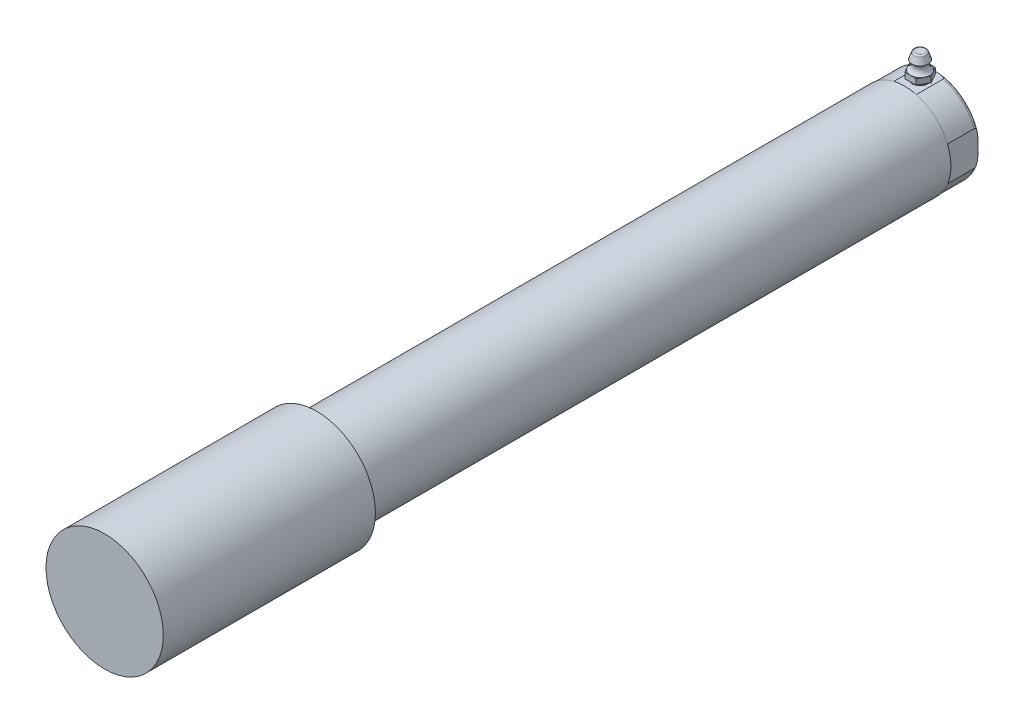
ISO-10303-21;
HEADER;
FILE_DESCRIPTION(('STEP AP214'),'2;1');
FILE_NAME('part.step','',(''),(''),'','','');
FILE_SCHEMA(('AUTOMOTIVE_DESIGN { 1 0 10303 214 1 1 1 1 }'));
ENDSEC;
DATA;
#1=APPLICATION_CONTEXT('core data for automotive mechanical design processes');
#2=APPLICATION_PROTOCOL_DEFINITION('international standard','automotive_design',2000,#1);
#3=PRODUCT_CONTEXT('',#1,'mechanical');
#4=PRODUCT('Part','Part','',(#3));
#5=PRODUCT_RELATED_PRODUCT_CATEGORY('part','',(#4));
#6=PRODUCT_DEFINITION_FORMATION('','',#4);
#7=PRODUCT_DEFINITION_CONTEXT('part definition',#1,'design');
#8=PRODUCT_DEFINITION('design','',#6,#7);
#9=PRODUCT_DEFINITION_SHAPE('','',#8);
#10=(LENGTH_UNIT() NAMED_UNIT(*) SI_UNIT(.MILLI.,.METRE.));
#11=(NAMED_UNIT(*) PLANE_ANGLE_UNIT() SI_UNIT($,.RADIAN.));
#12=(NAMED_UNIT(*) SI_UNIT($,.STERADIAN.) SOLID_ANGLE_UNIT());
#13=UNCERTAINTY_MEASURE_WITH_UNIT(LENGTH_MEASURE(1.E-05),#10,'distance_accuracy_value','');
#14=(GEOMETRIC_REPRESENTATION_CONTEXT(3) GLOBAL_UNCERTAINTY_ASSIGNED_CONTEXT((#13)) GLOBAL_UNIT_ASSIGNED_CONTEXT((#10,
#11,#12)) REPRESENTATION_CONTEXT('',''));
#15=CARTESIAN_POINT('',(0.,0.,0.));
#16=DIRECTION('',(0.,0.,1.));
#17=DIRECTION('',(1.,0.,0.));
#18=AXIS2_PLACEMENT_3D('',#15,#16,#17);
#19=CARTESIAN_POINT('',(0.,14.557375,-260.985));
#20=DIRECTION('',(0.,1.,0.));
#21=DIRECTION('',(-0.866025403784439,0.,0.5));
#22=AXIS2_PLACEMENT_3D('',#19,#20,#21);
#23=CONICAL_SURFACE('',#22,3.048,0.0447462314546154);
#24=CARTESIAN_POINT('',(0.,18.811875,-260.985));
#25=DIRECTION('',(0.,-1.,0.));
#26=DIRECTION('',(0.866025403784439,0.,-0.5));
#27=AXIS2_PLACEMENT_3D('',#24,#25,#26);
#28=CIRCLE('',#27,3.2385);
#29=CARTESIAN_POINT('',(2.80462327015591,18.811875,-262.60425));
#30=VERTEX_POINT('',#29);
#31=EDGE_CURVE('E256',#30,#30,#28,.T.);
#32=ORIENTED_EDGE('',*,*,#31,.T.);
#33=EDGE_LOOP('',(#32));
#34=FACE_BOUND('',#33,.T.);
#35=CARTESIAN_POINT('',(0.,18.291684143,-260.985));
#36=DIRECTION('',(0.,-1.,0.));
#37=DIRECTION('',(0.,0.,-1.));
#38=AXIS2_PLACEMENT_3D('',#35,#36,#37);
#39=CIRCLE('',#38,3.21520787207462);
#40=CARTESIAN_POINT('',(0.,18.291684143,-264.200207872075));
#41=VERTEX_POINT('',#40);
#42=EDGE_CURVE('E10',#41,#41,#39,.T.);
#43=ORIENTED_EDGE('',*,*,#42,.F.);
#44=EDGE_LOOP('',(#43));
#45=FACE_BOUND('',#44,.T.);
#46=ADVANCED_FACE('F16',(#34,#45),#23,.T.);
#47=CARTESIAN_POINT('',(2.29135888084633,21.701125,-264.95375));
#48=DIRECTION('',(0.,1.,0.));
#49=DIRECTION('',(0.5,0.,0.866025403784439));
#50=AXIS2_PLACEMENT_3D('',#47,#48,#49);
#51=PLANE('',#50);
#52=CARTESIAN_POINT('',(0.,21.701125,-260.985));
#53=DIRECTION('',(0.,-1.,0.));
#54=DIRECTION('',(0.866025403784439,0.,-0.5));
#55=AXIS2_PLACEMENT_3D('',#52,#53,#54);
#56=CIRCLE('',#55,3.96875);
#57=CARTESIAN_POINT('',(-3.43703832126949,21.701125,-259.000625));
#58=VERTEX_POINT('',#57);
#59=CARTESIAN_POINT('',(-3.43703832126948,21.701125,-262.969375));
#60=VERTEX_POINT('',#59);
#61=EDGE_CURVE('E723',#58,#60,#56,.T.);
#62=ORIENTED_EDGE('',*,*,#61,.T.);
#63=DIRECTION('',(-0.5,0.,0.866025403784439));
#64=VECTOR('',#63,1.);
#65=CARTESIAN_POINT('',(-2.29135888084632,21.701125,-264.95375));
#66=LINE('',#65,#64);
#67=CARTESIAN_POINT('',(-4.58271776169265,21.701125,-260.985));
#68=VERTEX_POINT('',#67);
#69=EDGE_CURVE('E267',#60,#68,#66,.T.);
#70=ORIENTED_EDGE('',*,*,#69,.T.);
#71=DIRECTION('',(0.5,0.,0.866025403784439));
#72=VECTOR('',#71,1.);
#73=CARTESIAN_POINT('',(-4.58271776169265,21.701125,-260.985));
#74=LINE('',#73,#72);
#75=EDGE_CURVE('E271',#68,#58,#74,.T.);
#76=ORIENTED_EDGE('',*,*,#75,.T.);
#77=EDGE_LOOP('',(#62,#70,#76));
#78=FACE_BOUND('',#77,.T.);
#79=ADVANCED_FACE('F410',(#78),#51,.T.);
#80=CARTESIAN_POINT('',(0.,21.701125,-257.01625));
#81=VERTEX_POINT('',#80);
#82=EDGE_CURVE('E730',#81,#58,#56,.T.);
#83=ORIENTED_EDGE('',*,*,#82,.T.);
#84=CARTESIAN_POINT('',(-2.29135888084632,21.701125,-257.01625));
#85=VERTEX_POINT('',#84);
#86=EDGE_CURVE('E270',#58,#85,#74,.T.);
#87=ORIENTED_EDGE('',*,*,#86,.T.);
#88=DIRECTION('',(1.,0.,0.));
#89=VECTOR('',#88,1.);
#90=CARTESIAN_POINT('',(-2.29135888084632,21.701125,-257.01625));
#91=LINE('',#90,#89);
#92=EDGE_CURVE('E275',#85,#81,#91,.T.);
#93=ORIENTED_EDGE('',*,*,#92,.T.);
#94=EDGE_LOOP('',(#83,#87,#93));
#95=FACE_BOUND('',#94,.T.);
#96=ADVANCED_FACE('F691',(#95),#51,.T.);
#97=CARTESIAN_POINT('',(3.4370383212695,21.701125,-259.000625));
#98=VERTEX_POINT('',#97);
#99=EDGE_CURVE('E94',#98,#81,#56,.T.);
#100=ORIENTED_EDGE('',*,*,#99,.T.);
#101=CARTESIAN_POINT('',(2.29135888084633,21.701125,-257.01625));
#102=VERTEX_POINT('',#101);
#103=EDGE_CURVE('E274',#81,#102,#91,.T.);
#104=ORIENTED_EDGE('',*,*,#103,.T.);
#105=DIRECTION('',(0.5,0.,-0.866025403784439));
#106=VECTOR('',#105,1.);
#107=CARTESIAN_POINT('',(2.29135888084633,21.701125,-257.01625));
#108=LINE('',#107,#106);
#109=EDGE_CURVE('E279',#102,#98,#108,.T.);
#110=ORIENTED_EDGE('',*,*,#109,.T.);
#111=EDGE_LOOP('',(#100,#104,#110));
#112=FACE_BOUND('',#111,.T.);
#113=ADVANCED_FACE('F684',(#112),#51,.T.);
#114=CARTESIAN_POINT('',(3.4370383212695,21.701125,-262.969375));
#115=VERTEX_POINT('',#114);
#116=EDGE_CURVE('E101',#115,#98,#56,.T.);
#117=ORIENTED_EDGE('',*,*,#116,.T.);
#118=CARTESIAN_POINT('',(4.58271776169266,21.701125,-260.985));
#119=VERTEX_POINT('',#118);
#120=EDGE_CURVE('E278',#98,#119,#108,.T.);
#121=ORIENTED_EDGE('',*,*,#120,.T.);
#122=DIRECTION('',(-0.5,0.,-0.866025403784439));
#123=VECTOR('',#122,1.);
#124=CARTESIAN_POINT('',(4.58271776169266,21.701125,-260.985));
#125=LINE('',#124,#123);
#126=EDGE_CURVE('E260',#119,#115,#125,.T.);
#127=ORIENTED_EDGE('',*,*,#126,.T.);
#128=EDGE_LOOP('',(#117,#121,#127));
#129=FACE_BOUND('',#128,.T.);
#130=ADVANCED_FACE('F677',(#129),#51,.T.);
#131=CARTESIAN_POINT('',(0.,21.701125,-264.95375));
#132=VERTEX_POINT('',#131);
#133=EDGE_CURVE('E251',#132,#115,#56,.T.);
#134=ORIENTED_EDGE('',*,*,#133,.T.);
#135=CARTESIAN_POINT('',(2.29135888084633,21.701125,-264.95375));
#136=VERTEX_POINT('',#135);
#137=EDGE_CURVE('E263',#115,#136,#125,.T.);
#138=ORIENTED_EDGE('',*,*,#137,.T.);
#139=DIRECTION('',(-1.,0.,0.));
#140=VECTOR('',#139,1.);
#141=CARTESIAN_POINT('',(2.29135888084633,21.701125,-264.95375));
#142=LINE('',#141,#140);
#143=EDGE_CURVE('E264',#136,#132,#142,.T.);
#144=ORIENTED_EDGE('',*,*,#143,.T.);
#145=EDGE_LOOP('',(#134,#138,#144));
#146=FACE_BOUND('',#145,.T.);
#147=ADVANCED_FACE('F380',(#146),#51,.T.);
#148=CARTESIAN_POINT('',(4.58271776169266,21.701125,-260.985));
#149=DIRECTION('',(-0.866025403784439,0.,0.5));
#150=DIRECTION('',(0.,-1.,0.));
#151=AXIS2_PLACEMENT_3D('',#148,#149,#150);
#152=PLANE('',#151);
#153=DIRECTION('',(-0.5,0.,-0.866025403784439));
#154=VECTOR('',#153,1.);
#155=CARTESIAN_POINT('',(4.58271776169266,19.319875,-260.985));
#156=LINE('',#155,#154);
#157=CARTESIAN_POINT('',(4.58271776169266,19.319875,-260.985));
#158=VERTEX_POINT('',#157);
#159=CARTESIAN_POINT('',(2.29135888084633,19.3198749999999,-264.95375));
#160=VERTEX_POINT('',#159);
#161=EDGE_CURVE('E259',#158,#160,#156,.T.);
#162=ORIENTED_EDGE('',*,*,#161,.T.);
#163=DIRECTION('',(0.,-1.,0.));
#164=VECTOR('',#163,1.);
#165=CARTESIAN_POINT('',(2.29135888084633,21.701125,-264.95375));
#166=LINE('',#165,#164);
#167=EDGE_CURVE('E308',#136,#160,#166,.T.);
#168=ORIENTED_EDGE('',*,*,#167,.F.);
#169=ORIENTED_EDGE('',*,*,#137,.F.);
#170=ORIENTED_EDGE('',*,*,#126,.F.);
#171=DIRECTION('',(0.,-1.,0.));
#172=VECTOR('',#171,1.);
#173=CARTESIAN_POINT('',(4.58271776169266,21.701125,-260.985));
#174=LINE('',#173,#172);
#175=EDGE_CURVE('E281',#119,#158,#174,.T.);
#176=ORIENTED_EDGE('',*,*,#175,.T.);
#177=EDGE_LOOP('',(#162,#168,#169,#170,#176));
#178=FACE_BOUND('',#177,.T.);
#179=ADVANCED_FACE('F376',(#178),#152,.F.);
#180=CARTESIAN_POINT('',(2.29135888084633,21.701125,-264.95375));
#181=DIRECTION('',(0.,0.,1.));
#182=DIRECTION('',(1.,0.,0.));
#183=AXIS2_PLACEMENT_3D('',#180,#181,#182);
#184=PLANE('',#183);
#185=DIRECTION('',(-1.,0.,0.));
#186=VECTOR('',#185,1.);
#187=CARTESIAN_POINT('',(2.29135888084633,19.3198749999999,-264.95375));
#188=LINE('',#187,#186);
#189=CARTESIAN_POINT('',(-2.29135888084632,19.319875,-264.95375));
#190=VERTEX_POINT('',#189);
#191=EDGE_CURVE('E284',#160,#190,#188,.T.);
#192=ORIENTED_EDGE('',*,*,#191,.T.);
#193=DIRECTION('',(0.,-1.,0.));
#194=VECTOR('',#193,1.);
#195=CARTESIAN_POINT('',(-2.29135888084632,21.701125,-264.95375));
#196=LINE('',#195,#194);
#197=CARTESIAN_POINT('',(-2.29135888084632,21.701125,-264.95375));
#198=VERTEX_POINT('',#197);
#199=EDGE_CURVE('E305',#198,#190,#196,.T.);
#200=ORIENTED_EDGE('',*,*,#199,.F.);
#201=EDGE_CURVE('E262',#132,#198,#142,.T.);
#202=ORIENTED_EDGE('',*,*,#201,.F.);
#203=ORIENTED_EDGE('',*,*,#143,.F.);
#204=ORIENTED_EDGE('',*,*,#167,.T.);
#205=EDGE_LOOP('',(#192,#200,#202,#203,#204));
#206=FACE_BOUND('',#205,.T.);
#207=ADVANCED_FACE('F379',(#206),#184,.F.);
#208=CARTESIAN_POINT('',(-2.29135888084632,21.701125,-264.95375));
#209=DIRECTION('',(0.866025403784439,0.,0.5));
#210=DIRECTION('',(0.5,0.,-0.866025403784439));
#211=AXIS2_PLACEMENT_3D('',#208,#209,#210);
#212=PLANE('',#211);
#213=DIRECTION('',(-0.5,0.,0.866025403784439));
#214=VECTOR('',#213,1.);
#215=CARTESIAN_POINT('',(-2.29135888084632,19.319875,-264.95375));
#216=LINE('',#215,#214);
#217=CARTESIAN_POINT('',(-4.58271776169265,19.319875,-260.985));
#218=VERTEX_POINT('',#217);
#219=EDGE_CURVE('E286',#190,#218,#216,.T.);
#220=ORIENTED_EDGE('',*,*,#219,.T.);
#221=DIRECTION('',(0.,-1.,0.));
#222=VECTOR('',#221,1.);
#223=CARTESIAN_POINT('',(-4.58271776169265,21.701125,-260.985));
#224=LINE('',#223,#222);
#225=EDGE_CURVE('E302',#68,#218,#224,.T.);
#226=ORIENTED_EDGE('',*,*,#225,.F.);
#227=ORIENTED_EDGE('',*,*,#69,.F.);
#228=EDGE_CURVE('E268',#198,#60,#66,.T.);
#229=ORIENTED_EDGE('',*,*,#228,.F.);
#230=ORIENTED_EDGE('',*,*,#199,.T.);
#231=EDGE_LOOP('',(#220,#226,#227,#229,#230));
#232=FACE_BOUND('',#231,.T.);
#233=ADVANCED_FACE('F384',(#232),#212,.F.);
#234=CARTESIAN_POINT('',(-4.58271776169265,21.701125,-260.985));
#235=DIRECTION('',(0.866025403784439,0.,-0.5));
#236=DIRECTION('',(-0.5,0.,-0.866025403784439));
#237=AXIS2_PLACEMENT_3D('',#234,#235,#236);
#238=PLANE('',#237);
#239=DIRECTION('',(0.5,0.,0.866025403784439));
#240=VECTOR('',#239,1.);
#241=CARTESIAN_POINT('',(-4.58271776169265,19.319875,-260.985));
#242=LINE('',#241,#240);
#243=CARTESIAN_POINT('',(-2.29135888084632,19.319875,-257.01625));
#244=VERTEX_POINT('',#243);
#245=EDGE_CURVE('E288',#218,#244,#242,.T.);
#246=ORIENTED_EDGE('',*,*,#245,.T.);
#247=DIRECTION('',(0.,-1.,0.));
#248=VECTOR('',#247,1.);
#249=CARTESIAN_POINT('',(-2.29135888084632,21.701125,-257.01625));
#250=LINE('',#249,#248);
#251=EDGE_CURVE('E299',#85,#244,#250,.T.);
#252=ORIENTED_EDGE('',*,*,#251,.F.);
#253=ORIENTED_EDGE('',*,*,#86,.F.);
#254=ORIENTED_EDGE('',*,*,#75,.F.);
#255=ORIENTED_EDGE('',*,*,#225,.T.);
#256=EDGE_LOOP('',(#246,#252,#253,#254,#255));
#257=FACE_BOUND('',#256,.T.);
#258=ADVANCED_FACE('F388',(#257),#238,.F.);
#259=CARTESIAN_POINT('',(-2.29135888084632,21.701125,-257.01625));
#260=DIRECTION('',(0.,0.,-1.));
#261=DIRECTION('',(-1.,0.,0.));
#262=AXIS2_PLACEMENT_3D('',#259,#260,#261);
#263=PLANE('',#262);
#264=DIRECTION('',(1.,0.,0.));
#265=VECTOR('',#264,1.);
#266=CARTESIAN_POINT('',(-2.29135888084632,19.319875,-257.01625));
#267=LINE('',#266,#265);
#268=CARTESIAN_POINT('',(2.29135888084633,19.319875,-257.01625));
#269=VERTEX_POINT('',#268);
#270=EDGE_CURVE('E290',#244,#269,#267,.T.);
#271=ORIENTED_EDGE('',*,*,#270,.T.);
#272=DIRECTION('',(0.,-1.,0.));
#273=VECTOR('',#272,1.);
#274=CARTESIAN_POINT('',(2.29135888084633,21.701125,-257.01625));
#275=LINE('',#274,#273);
#276=EDGE_CURVE('E296',#102,#269,#275,.T.);
#277=ORIENTED_EDGE('',*,*,#276,.F.);
#278=ORIENTED_EDGE('',*,*,#103,.F.);
#279=ORIENTED_EDGE('',*,*,#92,.F.);
#280=ORIENTED_EDGE('',*,*,#251,.T.);
#281=EDGE_LOOP('',(#271,#277,#278,#279,#280));
#282=FACE_BOUND('',#281,.T.);
#283=ADVANCED_FACE('F392',(#282),#263,.F.);
#284=CARTESIAN_POINT('',(2.29135888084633,21.701125,-257.01625));
#285=DIRECTION('',(-0.866025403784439,0.,-0.5));
#286=DIRECTION('',(-0.5,0.,0.866025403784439));
#287=AXIS2_PLACEMENT_3D('',#284,#285,#286);
#288=PLANE('',#287);
#289=DIRECTION('',(0.5,0.,-0.866025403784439));
#290=VECTOR('',#289,1.);
#291=CARTESIAN_POINT('',(2.29135888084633,19.319875,-257.01625));
#292=LINE('',#291,#290);
#293=EDGE_CURVE('E292',#269,#158,#292,.T.);
#294=ORIENTED_EDGE('',*,*,#293,.T.);
#295=ORIENTED_EDGE('',*,*,#175,.F.);
#296=ORIENTED_EDGE('',*,*,#120,.F.);
#297=ORIENTED_EDGE('',*,*,#109,.F.);
#298=ORIENTED_EDGE('',*,*,#276,.T.);
#299=EDGE_LOOP('',(#294,#295,#296,#297,#298));
#300=FACE_BOUND('',#299,.T.);
#301=ADVANCED_FACE('F396',(#300),#288,.F.);
#302=EDGE_CURVE('E731',#60,#132,#56,.T.);
#303=ORIENTED_EDGE('',*,*,#302,.T.);
#304=ORIENTED_EDGE('',*,*,#201,.T.);
#305=ORIENTED_EDGE('',*,*,#228,.T.);
#306=EDGE_LOOP('',(#303,#304,#305));
#307=FACE_BOUND('',#306,.T.);
#308=ADVANCED_FACE('F400',(#307),#51,.T.);
#309=CARTESIAN_POINT('',(2.29135888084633,19.3198749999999,-264.95375));
#310=DIRECTION('',(0.,1.,0.));
#311=DIRECTION('',(0.5,0.,0.866025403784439));
#312=AXIS2_PLACEMENT_3D('',#309,#310,#311);
#313=PLANE('',#312);
#314=CARTESIAN_POINT('',(0.,19.319875,-260.985));
#315=DIRECTION('',(0.,-1.,0.));
#316=DIRECTION('',(0.866025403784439,0.,-0.5));
#317=AXIS2_PLACEMENT_3D('',#314,#315,#316);
#318=CIRCLE('',#317,3.2385);
#319=CARTESIAN_POINT('',(2.80462327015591,19.319875,-262.60425));
#320=VERTEX_POINT('',#319);
#321=EDGE_CURVE('E253',#320,#320,#318,.T.);
#322=ORIENTED_EDGE('',*,*,#321,.F.);
#323=EDGE_LOOP('',(#322));
#324=FACE_BOUND('',#323,.T.);
#325=ORIENTED_EDGE('',*,*,#161,.F.);
#326=ORIENTED_EDGE('',*,*,#293,.F.);
#327=ORIENTED_EDGE('',*,*,#270,.F.);
#328=ORIENTED_EDGE('',*,*,#245,.F.);
#329=ORIENTED_EDGE('',*,*,#219,.F.);
#330=ORIENTED_EDGE('',*,*,#191,.F.);
#331=EDGE_LOOP('',(#325,#326,#327,#328,#329,#330));
#332=FACE_BOUND('',#331,.T.);
#333=ADVANCED_FACE('F402',(#324,#332),#313,.F.);
#334=CARTESIAN_POINT('',(0.,19.319875,-260.985));
#335=DIRECTION('',(0.,-1.,0.));
#336=DIRECTION('',(0.866025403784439,0.,-0.5));
#337=AXIS2_PLACEMENT_3D('',#334,#335,#336);
#338=CYLINDRICAL_SURFACE('',#337,3.2385);
#339=ORIENTED_EDGE('',*,*,#321,.T.);
#340=EDGE_LOOP('',(#339));
#341=FACE_BOUND('',#340,.T.);
#342=ORIENTED_EDGE('',*,*,#31,.F.);
#343=EDGE_LOOP('',(#342));
#344=FACE_BOUND('',#343,.T.);
#345=ADVANCED_FACE('F405',(#341,#344),#338,.T.);
#346=CARTESIAN_POINT('',(0.,25.4,-260.985));
#347=DIRECTION('',(0.,-1.,0.));
#348=DIRECTION('',(0.866025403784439,0.,-0.5));
#349=AXIS2_PLACEMENT_3D('',#346,#347,#348);
#350=CONICAL_SURFACE('',#349,3.3655,0.340381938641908);
#351=CARTESIAN_POINT('',(0.,27.9403915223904,-260.985));
#352=DIRECTION('',(0.,1.,0.));
#353=DIRECTION('',(-0.866025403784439,0.,0.5));
#354=AXIS2_PLACEMENT_3D('',#351,#352,#353);
#355=CIRCLE('',#354,2.46577800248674);
#356=CARTESIAN_POINT('',(-2.13542639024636,27.9403915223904,-259.752110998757));
#357=VERTEX_POINT('',#356);
#358=EDGE_CURVE('E311',#357,#357,#355,.F.);
#359=ORIENTED_EDGE('',*,*,#358,.T.);
#360=EDGE_LOOP('',(#359));
#361=FACE_BOUND('',#360,.T.);
#362=CARTESIAN_POINT('',(0.,25.4,-260.985));
#363=DIRECTION('',(0.,-1.,0.));
#364=DIRECTION('',(0.866025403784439,0.,-0.5));
#365=AXIS2_PLACEMENT_3D('',#362,#363,#364);
#366=CIRCLE('',#365,3.3655);
#367=CARTESIAN_POINT('',(2.91460849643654,25.4,-262.66775));
#368=VERTEX_POINT('',#367);
#369=EDGE_CURVE('E248',#368,#368,#366,.T.);
#370=ORIENTED_EDGE('',*,*,#369,.F.);
#371=EDGE_LOOP('',(#370));
#372=FACE_BOUND('',#371,.T.);
#373=ADVANCED_FACE('F411',(#361,#372),#350,.T.);
#374=CARTESIAN_POINT('',(0.,28.448,-260.985));
#375=DIRECTION('',(0.,1.,0.));
#376=DIRECTION('',(-0.866025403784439,0.,0.5));
#377=AXIS2_PLACEMENT_3D('',#374,#375,#376);
#378=PLANE('',#377);
#379=CARTESIAN_POINT('',(0.,28.448,-260.985));
#380=DIRECTION('',(0.,1.,0.));
#381=DIRECTION('',(-0.866025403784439,0.,0.5));
#382=AXIS2_PLACEMENT_3D('',#379,#380,#381);
#383=CIRCLE('',#382,1.7474960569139);
#384=CARTESIAN_POINT('',(-1.51337597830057,28.448,-260.111251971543));
#385=VERTEX_POINT('',#384);
#386=EDGE_CURVE('E314',#385,#385,#383,.T.);
#387=ORIENTED_EDGE('',*,*,#386,.T.);
#388=EDGE_LOOP('',(#387));
#389=FACE_BOUND('',#388,.T.);
#390=ADVANCED_FACE('F414',(#389),#378,.T.);
#391=CARTESIAN_POINT('',(0.,23.8016902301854,-260.985));
#392=DIRECTION('',(0.,-1.,0.));
#393=DIRECTION('',(0.866025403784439,0.,-0.5));
#394=AXIS2_PLACEMENT_3D('',#391,#392,#393);
#395=TOROIDAL_SURFACE('',#394,5.20693450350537,2.43833450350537);
#396=ORIENTED_EDGE('',*,*,#369,.T.);
#397=EDGE_LOOP('',(#396));
#398=FACE_BOUND('',#397,.T.);
#399=ORIENTED_EDGE('',*,*,#116,.F.);
#400=ORIENTED_EDGE('',*,*,#133,.F.);
#401=ORIENTED_EDGE('',*,*,#302,.F.);
#402=ORIENTED_EDGE('',*,*,#61,.F.);
#403=ORIENTED_EDGE('',*,*,#82,.F.);
#404=ORIENTED_EDGE('',*,*,#99,.F.);
#405=EDGE_LOOP('',(#399,#400,#401,#402,#403,#404));
#406=FACE_BOUND('',#405,.T.);
#407=ADVANCED_FACE('F363',(#398,#406),#395,.F.);
#408=CARTESIAN_POINT('',(0.,27.686,-260.985));
#409=DIRECTION('',(0.,1.,0.));
#410=DIRECTION('',(-0.866025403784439,0.,0.5));
#411=AXIS2_PLACEMENT_3D('',#408,#409,#410);
#412=TOROIDAL_SURFACE('',#411,1.7474960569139,0.762);
#413=ORIENTED_EDGE('',*,*,#386,.F.);
#414=EDGE_LOOP('',(#413));
#415=FACE_BOUND('',#414,.T.);
#416=ORIENTED_EDGE('',*,*,#358,.F.);
#417=EDGE_LOOP('',(#416));
#418=FACE_BOUND('',#417,.T.);
#419=ADVANCED_FACE('F352',(#415,#418),#412,.T.);
#420=CARTESIAN_POINT('',(0.,21.5,74.525));
#421=DIRECTION('',(0.,0.,1.));
#422=DIRECTION('',(1.,0.,0.));
#423=AXIS2_PLACEMENT_3D('',#420,#421,#422);
#424=PLANE('',#423);
#425=CARTESIAN_POINT('',(0.,0.,74.525));
#426=DIRECTION('',(0.,0.,-1.));
#427=DIRECTION('',(-1.,0.,0.));
#428=AXIS2_PLACEMENT_3D('',#425,#426,#427);
#429=CIRCLE('',#428,24.13);
#430=CARTESIAN_POINT('',(-24.13,0.,74.525));
#431=VERTEX_POINT('',#430);
#432=EDGE_CURVE('E320',#431,#431,#429,.T.);
#433=ORIENTED_EDGE('',*,*,#432,.F.);
#434=EDGE_LOOP('',(#433));
#435=FACE_BOUND('',#434,.T.);
#436=ADVANCED_FACE('F331',(#435),#424,.T.);
#437=CARTESIAN_POINT('',(0.,0.,-81.0418670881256));
#438=DIRECTION('',(0.,0.,1.));
#439=DIRECTION('',(1.,0.,0.));
#440=AXIS2_PLACEMENT_3D('',#437,#438,#439);
#441=CYLINDRICAL_SURFACE('',#440,24.13);
#442=CARTESIAN_POINT('',(0.,0.,-12.745960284));
#443=DIRECTION('',(0.,0.,1.));
#444=DIRECTION('',(1.,0.,0.));
#445=AXIS2_PLACEMENT_3D('',#442,#443,#444);
#446=CIRCLE('',#445,24.13);
#447=CARTESIAN_POINT('',(24.13,0.,-12.745960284));
#448=VERTEX_POINT('',#447);
#449=EDGE_CURVE('E317',#448,#448,#446,.F.);
#450=ORIENTED_EDGE('',*,*,#449,.F.);
#451=EDGE_LOOP('',(#450));
#452=FACE_BOUND('',#451,.T.);
#453=ORIENTED_EDGE('',*,*,#432,.T.);
#454=EDGE_LOOP('',(#453));
#455=FACE_BOUND('',#454,.T.);
#456=ADVANCED_FACE('F351',(#452,#455),#441,.T.);
#457=CARTESIAN_POINT('',(0.,0.,-12.745960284));
#458=DIRECTION('',(0.,0.,1.));
#459=DIRECTION('',(1.,0.,0.));
#460=AXIS2_PLACEMENT_3D('',#457,#458,#459);
#461=PLANE('',#460);
#462=CARTESIAN_POINT('',(0.,0.,-12.745960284));
#463=DIRECTION('',(0.,0.,1.));
#464=DIRECTION('',(1.,0.,0.));
#465=AXIS2_PLACEMENT_3D('',#462,#463,#464);
#466=CIRCLE('',#465,19.04238);
#467=CARTESIAN_POINT('',(19.04238,0.,-12.745960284));
#468=VERTEX_POINT('',#467);
#469=EDGE_CURVE('E20',#468,#468,#466,.T.);
#470=ORIENTED_EDGE('',*,*,#469,.T.);
#471=EDGE_LOOP('',(#470));
#472=FACE_BOUND('',#471,.T.);
#473=ORIENTED_EDGE('',*,*,#449,.T.);
#474=EDGE_LOOP('',(#473));
#475=FACE_BOUND('',#474,.T.);
#476=ADVANCED_FACE('F350',(#472,#475),#461,.F.);
#477=CARTESIAN_POINT('',(0.,0.,-9.525));
#478=DIRECTION('',(0.,0.,1.));
#479=DIRECTION('',(1.,0.,0.));
#480=AXIS2_PLACEMENT_3D('',#477,#478,#479);
#481=CYLINDRICAL_SURFACE('',#480,19.04238);
#482=CARTESIAN_POINT('',(0.,0.,-254.635));
#483=DIRECTION('',(0.,0.,1.));
#484=DIRECTION('',(1.,0.,0.));
#485=AXIS2_PLACEMENT_3D('',#482,#483,#484);
#486=CIRCLE('',#485,19.04238);
#487=CARTESIAN_POINT('',(19.04238,0.,-254.635));
#488=VERTEX_POINT('',#487);
#489=EDGE_CURVE('E322',#488,#488,#486,.T.);
#490=ORIENTED_EDGE('',*,*,#489,.T.);
#491=EDGE_LOOP('',(#490));
#492=FACE_BOUND('',#491,.T.);
#493=ORIENTED_EDGE('',*,*,#469,.F.);
#494=EDGE_LOOP('',(#493));
#495=FACE_BOUND('',#494,.T.);
#496=ADVANCED_FACE('F326',(#492,#495),#481,.T.);
#497=CARTESIAN_POINT('',(0.,0.,-254.635));
#498=DIRECTION('',(0.,0.,-1.));
#499=DIRECTION('',(-1.,0.,0.));
#500=AXIS2_PLACEMENT_3D('',#497,#498,#499);
#501=PLANE('',#500);
#502=ORIENTED_EDGE('',*,*,#489,.F.);
#503=EDGE_LOOP('',(#502));
#504=FACE_BOUND('',#503,.T.);
#505=CARTESIAN_POINT('',(0.,0.,-254.635));
#506=DIRECTION('',(0.,0.,-1.));
#507=DIRECTION('',(0.,-1.,0.));
#508=AXIS2_PLACEMENT_3D('',#505,#506,#507);
#509=CIRCLE('',#508,18.875);
#510=CARTESIAN_POINT('',(-17.4893999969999,7.09834577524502,-254.635));
#511=VERTEX_POINT('',#510);
#512=CARTESIAN_POINT('',(-4.65616969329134,18.291684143,-254.635));
#513=VERTEX_POINT('',#512);
#514=EDGE_CURVE('E222',#511,#513,#509,.T.);
#515=ORIENTED_EDGE('',*,*,#514,.F.);
#516=DIRECTION('',(0.,-1.,0.));
#517=VECTOR('',#516,1.);
#518=CARTESIAN_POINT('',(-17.4893999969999,7.09834577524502,-254.635));
#519=LINE('',#518,#517);
#520=CARTESIAN_POINT('',(-17.4893999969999,-7.098345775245,-254.635));
#521=VERTEX_POINT('',#520);
#522=EDGE_CURVE('E335',#511,#521,#519,.T.);
#523=ORIENTED_EDGE('',*,*,#522,.T.);
#524=CARTESIAN_POINT('',(17.4893999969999,-7.09834577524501,-254.635));
#525=VERTEX_POINT('',#524);
#526=EDGE_CURVE('E221',#525,#521,#509,.T.);
#527=ORIENTED_EDGE('',*,*,#526,.F.);
#528=DIRECTION('',(0.,1.,0.));
#529=VECTOR('',#528,1.);
#530=CARTESIAN_POINT('',(17.4893999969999,7.09834577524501,-254.635));
#531=LINE('',#530,#529);
#532=CARTESIAN_POINT('',(17.4893999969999,7.09834577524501,-254.635));
#533=VERTEX_POINT('',#532);
#534=EDGE_CURVE('E157',#525,#533,#531,.T.);
#535=ORIENTED_EDGE('',*,*,#534,.T.);
#536=CARTESIAN_POINT('',(4.65616969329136,18.291684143,-254.635));
#537=VERTEX_POINT('',#536);
#538=EDGE_CURVE('E213',#537,#533,#509,.T.);
#539=ORIENTED_EDGE('',*,*,#538,.F.);
#540=DIRECTION('',(-1.,0.,0.));
#541=VECTOR('',#540,1.);
#542=CARTESIAN_POINT('',(4.65616969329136,18.291684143,-254.635));
#543=LINE('',#542,#541);
#544=EDGE_CURVE('E107',#537,#513,#543,.T.);
#545=ORIENTED_EDGE('',*,*,#544,.T.);
#546=EDGE_LOOP('',(#515,#523,#527,#535,#539,#545));
#547=FACE_BOUND('',#546,.T.);
#548=ADVANCED_FACE('F18',(#504,#547),#501,.T.);
#549=CARTESIAN_POINT('',(0.,0.,-239.649));
#550=DIRECTION('',(0.,0.,-1.));
#551=DIRECTION('',(0.,-1.,0.));
#552=AXIS2_PLACEMENT_3D('',#549,#550,#551);
#553=CONICAL_SURFACE('',#552,9.25,1.02974424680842);
#554=CARTESIAN_POINT('',(0.,0.,-234.09103912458));
#555=VERTEX_POINT('',#554);
#556=VERTEX_LOOP('',#555);
#557=FACE_BOUND('',#556,.T.);
#558=CARTESIAN_POINT('',(0.,0.,-239.649));
#559=DIRECTION('',(0.,0.,-1.));
#560=DIRECTION('',(0.,-1.,0.));
#561=AXIS2_PLACEMENT_3D('',#558,#559,#560);
#562=CIRCLE('',#561,9.25);
#563=CARTESIAN_POINT('',(0.,-9.24999999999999,-239.649));
#564=VERTEX_POINT('',#563);
#565=EDGE_CURVE('E214',#564,#564,#562,.T.);
#566=ORIENTED_EDGE('',*,*,#565,.T.);
#567=EDGE_LOOP('',(#566));
#568=FACE_BOUND('',#567,.T.);
#569=ADVANCED_FACE('F189',(#557,#568),#553,.F.);
#570=CARTESIAN_POINT('',(0.,0.,-272.059212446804));
#571=DIRECTION('',(0.,0.,-1.));
#572=DIRECTION('',(0.,-1.,0.));
#573=AXIS2_PLACEMENT_3D('',#570,#571,#572);
#574=CYLINDRICAL_SURFACE('',#573,9.25);
#575=CARTESIAN_POINT('',(0.,0.,-266.5222));
#576=DIRECTION('',(0.,0.,1.));
#577=DIRECTION('',(0.,1.,0.));
#578=AXIS2_PLACEMENT_3D('',#575,#576,#577);
#579=CIRCLE('',#578,9.25);
#580=CARTESIAN_POINT('',(0.,9.25,-266.5222));
#581=VERTEX_POINT('',#580);
#582=EDGE_CURVE('E243',#581,#581,#579,.F.);
#583=ORIENTED_EDGE('',*,*,#582,.T.);
#584=EDGE_LOOP('',(#583));
#585=FACE_BOUND('',#584,.T.);
#586=ORIENTED_EDGE('',*,*,#565,.F.);
#587=EDGE_LOOP('',(#586));
#588=FACE_BOUND('',#587,.T.);
#589=ADVANCED_FACE('F192',(#585,#588),#574,.F.);
#590=CARTESIAN_POINT('',(0.,0.,-266.5222));
#591=DIRECTION('',(0.,0.,-1.));
#592=DIRECTION('',(0.,-1.,0.));
#593=AXIS2_PLACEMENT_3D('',#590,#591,#592);
#594=CONICAL_SURFACE('',#593,9.25,0.785398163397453);
#595=CARTESIAN_POINT('',(0.,0.,-267.335));
#596=DIRECTION('',(0.,0.,1.));
#597=DIRECTION('',(0.,1.,0.));
#598=AXIS2_PLACEMENT_3D('',#595,#596,#597);
#599=CIRCLE('',#598,10.0628);
#600=CARTESIAN_POINT('',(0.,10.0628,-267.335));
#601=VERTEX_POINT('',#600);
#602=EDGE_CURVE('E26',#601,#601,#599,.T.);
#603=ORIENTED_EDGE('',*,*,#602,.F.);
#604=EDGE_LOOP('',(#603));
#605=FACE_BOUND('',#604,.T.);
#606=ORIENTED_EDGE('',*,*,#582,.F.);
#607=EDGE_LOOP('',(#606));
#608=FACE_BOUND('',#607,.T.);
#609=ADVANCED_FACE('F196',(#605,#608),#594,.F.);
#610=CARTESIAN_POINT('',(0.,9.25,-267.335));
#611=DIRECTION('',(0.,0.,1.));
#612=DIRECTION('',(0.,1.,0.));
#613=AXIS2_PLACEMENT_3D('',#610,#611,#612);
#614=PLANE('',#613);
#615=ORIENTED_EDGE('',*,*,#602,.T.);
#616=EDGE_LOOP('',(#615));
#617=FACE_BOUND('',#616,.T.);
#618=CARTESIAN_POINT('',(0.,0.,-267.335));
#619=DIRECTION('',(0.,0.,1.));
#620=DIRECTION('',(0.,1.,0.));
#621=AXIS2_PLACEMENT_3D('',#618,#619,#620);
#622=CIRCLE('',#621,17.2875);
#623=CARTESIAN_POINT('',(0.,17.2875,-267.335));
#624=VERTEX_POINT('',#623);
#625=EDGE_CURVE('E149',#624,#624,#622,.F.);
#626=ORIENTED_EDGE('',*,*,#625,.T.);
#627=EDGE_LOOP('',(#626));
#628=FACE_BOUND('',#627,.T.);
#629=ADVANCED_FACE('F198',(#617,#628),#614,.F.);
#630=CARTESIAN_POINT('',(0.,0.,-272.059212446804));
#631=DIRECTION('',(0.,0.,-1.));
#632=DIRECTION('',(0.,-1.,0.));
#633=AXIS2_PLACEMENT_3D('',#630,#631,#632);
#634=CYLINDRICAL_SURFACE('',#633,18.875);
#635=ORIENTED_EDGE('',*,*,#526,.T.);
#636=DIRECTION('',(0.,0.,-1.));
#637=VECTOR('',#636,1.);
#638=CARTESIAN_POINT('',(-17.4893999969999,-7.098345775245,-254.635));
#639=LINE('',#638,#637);
#640=CARTESIAN_POINT('',(-17.4893999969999,-7.098345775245,-265.74749999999));
#641=VERTEX_POINT('',#640);
#642=EDGE_CURVE('E144',#521,#641,#639,.T.);
#643=ORIENTED_EDGE('',*,*,#642,.T.);
#644=CARTESIAN_POINT('',(0.,0.,-265.7475));
#645=DIRECTION('',(0.,0.,1.));
#646=DIRECTION('',(0.,1.,0.));
#647=AXIS2_PLACEMENT_3D('',#644,#645,#646);
#648=CIRCLE('',#647,18.875);
#649=CARTESIAN_POINT('',(17.4893999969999,-7.098345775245,-265.7475));
#650=VERTEX_POINT('',#649);
#651=EDGE_CURVE('E139',#641,#650,#648,.T.);
#652=ORIENTED_EDGE('',*,*,#651,.T.);
#653=DIRECTION('',(0.,0.,-1.));
#654=VECTOR('',#653,1.);
#655=CARTESIAN_POINT('',(17.4893999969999,-7.09834577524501,-254.635));
#656=LINE('',#655,#654);
#657=EDGE_CURVE('E142',#525,#650,#656,.T.);
#658=ORIENTED_EDGE('',*,*,#657,.F.);
#659=EDGE_LOOP('',(#635,#643,#652,#658));
#660=FACE_BOUND('',#659,.T.);
#661=ADVANCED_FACE('F141',(#660),#634,.T.);
#662=CARTESIAN_POINT('',(17.4893999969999,7.098345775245,-265.74749999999));
#663=VERTEX_POINT('',#662);
#664=CARTESIAN_POINT('',(4.65616969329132,18.291684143,-265.7475));
#665=VERTEX_POINT('',#664);
#666=EDGE_CURVE('E151',#663,#665,#648,.T.);
#667=ORIENTED_EDGE('',*,*,#666,.T.);
#668=DIRECTION('',(0.,0.,-1.));
#669=VECTOR('',#668,1.);
#670=CARTESIAN_POINT('',(4.65616969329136,18.291684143,-254.635));
#671=LINE('',#670,#669);
#672=EDGE_CURVE('E35',#537,#665,#671,.T.);
#673=ORIENTED_EDGE('',*,*,#672,.F.);
#674=ORIENTED_EDGE('',*,*,#538,.T.);
#675=DIRECTION('',(0.,0.,-1.));
#676=VECTOR('',#675,1.);
#677=CARTESIAN_POINT('',(17.4893999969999,7.09834577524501,-254.635));
#678=LINE('',#677,#676);
#679=EDGE_CURVE('E159',#533,#663,#678,.T.);
#680=ORIENTED_EDGE('',*,*,#679,.T.);
#681=EDGE_LOOP('',(#667,#673,#674,#680));
#682=FACE_BOUND('',#681,.T.);
#683=ADVANCED_FACE('F201',(#682),#634,.T.);
#684=ORIENTED_EDGE('',*,*,#514,.T.);
#685=DIRECTION('',(0.,0.,-1.));
#686=VECTOR('',#685,1.);
#687=CARTESIAN_POINT('',(-4.65616969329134,18.291684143,-254.635));
#688=LINE('',#687,#686);
#689=CARTESIAN_POINT('',(-4.65616969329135,18.291684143,-265.7475));
#690=VERTEX_POINT('',#689);
#691=EDGE_CURVE('E341',#513,#690,#688,.T.);
#692=ORIENTED_EDGE('',*,*,#691,.T.);
#693=CARTESIAN_POINT('',(-17.4893999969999,7.09834577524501,-265.7475));
#694=VERTEX_POINT('',#693);
#695=EDGE_CURVE('E148',#690,#694,#648,.T.);
#696=ORIENTED_EDGE('',*,*,#695,.T.);
#697=DIRECTION('',(0.,0.,-1.));
#698=VECTOR('',#697,1.);
#699=CARTESIAN_POINT('',(-17.4893999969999,7.09834577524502,-254.635));
#700=LINE('',#699,#698);
#701=EDGE_CURVE('E338',#511,#694,#700,.T.);
#702=ORIENTED_EDGE('',*,*,#701,.F.);
#703=EDGE_LOOP('',(#684,#692,#696,#702));
#704=FACE_BOUND('',#703,.T.);
#705=ADVANCED_FACE('F203',(#704),#634,.T.);
#706=CARTESIAN_POINT('',(0.,0.,-265.7475));
#707=DIRECTION('',(0.,0.,1.));
#708=DIRECTION('',(0.,1.,0.));
#709=AXIS2_PLACEMENT_3D('',#706,#707,#708);
#710=TOROIDAL_SURFACE('',#709,17.2875,1.5875);
#711=CARTESIAN_POINT('',(0.,18.291684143,-266.977040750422));
#712=CARTESIAN_POINT('',(-0.266968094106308,18.291684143,-266.97704218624));
#713=CARTESIAN_POINT('',(-0.533937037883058,18.2916841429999,-266.972327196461));
#714=CARTESIAN_POINT('',(-1.06745766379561,18.2916841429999,-266.952721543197));
#715=CARTESIAN_POINT('',(-1.33400944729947,18.2916841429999,-266.937833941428));
#716=CARTESIAN_POINT('',(-1.73241897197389,18.2916841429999,-266.905917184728));
#717=CARTESIAN_POINT('',(-1.86466662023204,18.291684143,-266.893721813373));
#718=CARTESIAN_POINT('',(-2.1287858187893,18.291684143,-266.865554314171));
#719=CARTESIAN_POINT('',(-2.26065731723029,18.291684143,-266.849581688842));
#720=CARTESIAN_POINT('',(-2.52360260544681,18.291684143,-266.813088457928));
#721=CARTESIAN_POINT('',(-2.65467720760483,18.291684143,-266.792573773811));
#722=CARTESIAN_POINT('',(-2.9157909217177,18.291684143,-266.745838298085));
#723=CARTESIAN_POINT('',(-3.04583039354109,18.291684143,-266.719619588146));
#724=CARTESIAN_POINT('',(-3.22745930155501,18.291684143,-266.677489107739));
#725=CARTESIAN_POINT('',(-3.27977512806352,18.291684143,-266.664703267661));
#726=CARTESIAN_POINT('',(-3.38404189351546,18.291684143,-266.637716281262));
#727=CARTESIAN_POINT('',(-3.43599279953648,18.291684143,-266.623515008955));
#728=CARTESIAN_POINT('',(-3.5914707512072,18.291684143,-266.578421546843));
#729=CARTESIAN_POINT('',(-3.69433373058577,18.291684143,-266.545104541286));
#730=CARTESIAN_POINT('',(-3.84663336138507,18.291684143,-266.488330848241));
#731=CARTESIAN_POINT('',(-3.89729860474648,18.291684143,-266.468163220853));
#732=CARTESIAN_POINT('',(-3.99744785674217,18.291684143,-266.425098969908));
#733=CARTESIAN_POINT('',(-4.04693234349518,18.291684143,-266.402203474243));
#734=CARTESIAN_POINT('',(-4.14408858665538,18.291684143,-266.353117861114));
#735=CARTESIAN_POINT('',(-4.19176492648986,18.291684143,-266.326936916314));
#736=CARTESIAN_POINT('',(-4.2845290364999,18.291684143,-266.270382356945));
#737=CARTESIAN_POINT('',(-4.32962086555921,18.291684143,-266.240015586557));
#738=CARTESIAN_POINT('',(-4.40740204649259,18.291684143,-266.180200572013));
#739=CARTESIAN_POINT('',(-4.44080933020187,18.291684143,-266.151697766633));
#740=CARTESIAN_POINT('',(-4.50335833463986,18.291684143,-266.090325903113));
#741=CARTESIAN_POINT('',(-4.53251165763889,18.291684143,-266.057469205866));
#742=CARTESIAN_POINT('',(-4.57412151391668,18.291684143,-266.000164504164));
#743=CARTESIAN_POINT('',(-4.58870879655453,18.291684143,-265.977278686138));
#744=CARTESIAN_POINT('',(-4.61428922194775,18.291684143,-265.929562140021));
#745=CARTESIAN_POINT('',(-4.62528714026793,18.291684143,-265.904734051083));
#746=CARTESIAN_POINT('',(-4.64131151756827,18.291684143,-265.857425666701));
#747=CARTESIAN_POINT('',(-4.64699618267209,18.291684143,-265.835171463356));
#748=CARTESIAN_POINT('',(-4.65451170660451,18.291684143,-265.790022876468));
#749=CARTESIAN_POINT('',(-4.65634594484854,18.291684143,-265.767129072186));
#750=CARTESIAN_POINT('',(-4.65596628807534,18.291684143,-265.721349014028));
#751=CARTESIAN_POINT('',(-4.65374768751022,18.291684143,-265.698462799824));
#752=CARTESIAN_POINT('',(-4.64549500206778,18.291684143,-265.653389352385));
#753=CARTESIAN_POINT('',(-4.63945743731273,18.291684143,-265.631202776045));
#754=CARTESIAN_POINT('',(-4.62179270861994,18.291684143,-265.581471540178));
#755=CARTESIAN_POINT('',(-4.60902742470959,18.291684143,-265.554335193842));
#756=CARTESIAN_POINT('',(-4.5793525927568,18.291684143,-265.502443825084));
#757=CARTESIAN_POINT('',(-4.5624339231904,18.291684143,-265.477694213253));
#758=CARTESIAN_POINT('',(-4.51332136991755,18.291684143,-265.414712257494));
#759=CARTESIAN_POINT('',(-4.4784897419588,18.291684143,-265.378561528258));
#760=CARTESIAN_POINT('',(-4.40409691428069,18.291684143,-265.311578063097));
#761=CARTESIAN_POINT('',(-4.36452274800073,18.291684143,-265.280760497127));
#762=CARTESIAN_POINT('',(-4.26799881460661,18.291684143,-265.213167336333));
#763=CARTESIAN_POINT('',(-4.20984730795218,18.291684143,-265.178129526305));
#764=CARTESIAN_POINT('',(-4.09048004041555,18.291684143,-265.113643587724));
#765=CARTESIAN_POINT('',(-4.02925830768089,18.291684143,-265.08420693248));
#766=CARTESIAN_POINT('',(-3.90461652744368,18.291684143,-265.029525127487));
#767=CARTESIAN_POINT('',(-3.84118677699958,18.291684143,-265.004302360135));
#768=CARTESIAN_POINT('',(-3.71313574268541,18.291684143,-264.957355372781));
#769=CARTESIAN_POINT('',(-3.64851566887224,18.291684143,-264.935627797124));
#770=CARTESIAN_POINT('',(-3.46980250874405,18.291684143,-264.87980168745));
#771=CARTESIAN_POINT('',(-3.35481181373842,18.291684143,-264.848586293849));
#772=CARTESIAN_POINT('',(-3.12327845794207,18.291684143,-264.792471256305));
#773=CARTESIAN_POINT('',(-3.00673488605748,18.291684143,-264.767575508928));
#774=CARTESIAN_POINT('',(-2.77246830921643,18.291684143,-264.722679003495));
#775=CARTESIAN_POINT('',(-2.6547433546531,18.291684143,-264.702688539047));
#776=CARTESIAN_POINT('',(-2.41867674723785,18.291684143,-264.666713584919));
#777=CARTESIAN_POINT('',(-2.30033500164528,18.291684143,-264.650729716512));
#778=CARTESIAN_POINT('',(-1.9444091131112,18.291684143,-264.607690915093));
#779=CARTESIAN_POINT('',(-1.70622425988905,18.291684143,-264.585602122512));
#780=CARTESIAN_POINT('',(-1.2294869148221,18.291684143,-264.551247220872));
#781=CARTESIAN_POINT('',(-0.990935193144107,18.291684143,-264.538969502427));
#782=CARTESIAN_POINT('',(-0.516660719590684,18.291684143,-264.522638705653));
#783=CARTESIAN_POINT('',(-0.280941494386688,18.291684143,-264.518480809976));
#784=CARTESIAN_POINT('',(0.190605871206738,18.291684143,-264.517528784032));
#785=CARTESIAN_POINT('',(0.426434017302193,18.291684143,-264.520737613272));
#786=CARTESIAN_POINT('',(0.897277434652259,18.291684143,-264.534929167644));
#787=CARTESIAN_POINT('',(1.13229327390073,18.2916841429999,-264.545892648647));
#788=CARTESIAN_POINT('',(1.60167679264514,18.2916841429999,-264.576998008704));
#789=CARTESIAN_POINT('',(1.83604467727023,18.291684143,-264.597136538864));
#790=CARTESIAN_POINT('',(2.18673748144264,18.291684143,-264.636469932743));
#791=CARTESIAN_POINT('',(2.30357320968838,18.2916841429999,-264.651115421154));
#792=CARTESIAN_POINT('',(2.53675653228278,18.2916841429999,-264.684067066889));
#793=CARTESIAN_POINT('',(2.6531040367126,18.2916841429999,-264.702373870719));
#794=CARTESIAN_POINT('',(2.88511813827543,18.2916841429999,-264.743471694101));
#795=CARTESIAN_POINT('',(3.00078410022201,18.2916841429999,-264.766266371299));
#796=CARTESIAN_POINT('',(3.23082037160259,18.2916841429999,-264.817507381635));
#797=CARTESIAN_POINT('',(3.34519121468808,18.291684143,-264.845951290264));
#798=CARTESIAN_POINT('',(3.57228209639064,18.291684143,-264.910387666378));
#799=CARTESIAN_POINT('',(3.68499556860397,18.2916841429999,-264.946404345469));
#800=CARTESIAN_POINT('',(3.85096152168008,18.2916841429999,-265.008287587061));
#801=CARTESIAN_POINT('',(3.90568869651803,18.2916841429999,-265.030187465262));
#802=CARTESIAN_POINT('',(4.01372293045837,18.2916841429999,-265.077223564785));
#803=CARTESIAN_POINT('',(4.06703074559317,18.291684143,-265.102358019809));
#804=CARTESIAN_POINT('',(4.16566317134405,18.291684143,-265.153632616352));
#805=CARTESIAN_POINT('',(4.21121031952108,18.2916841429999,-265.179340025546));
#806=CARTESIAN_POINT('',(4.29999562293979,18.2916841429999,-265.234907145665));
#807=CARTESIAN_POINT('',(4.34322452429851,18.291684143,-265.264781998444));
#808=CARTESIAN_POINT('',(4.42635777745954,18.291684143,-265.330276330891));
#809=CARTESIAN_POINT('',(4.46619421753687,18.2916841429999,-265.365983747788));
#810=CARTESIAN_POINT('',(4.53843775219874,18.2916841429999,-265.444231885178));
#811=CARTESIAN_POINT('',(4.57090086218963,18.291684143,-265.486716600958));
#812=CARTESIAN_POINT('',(4.60859163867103,18.291684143,-265.554076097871));
#813=CARTESIAN_POINT('',(4.61904149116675,18.2916841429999,-265.57600451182));
#814=CARTESIAN_POINT('',(4.63640788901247,18.2916841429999,-265.62123115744));
#815=CARTESIAN_POINT('',(4.64332771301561,18.291684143,-265.644528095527));
#816=CARTESIAN_POINT('',(4.65299480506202,18.291684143,-265.692188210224));
#817=CARTESIAN_POINT('',(4.6557086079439,18.2916841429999,-265.716558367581));
#818=CARTESIAN_POINT('',(4.65652182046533,18.2916841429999,-265.765377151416));
#819=CARTESIAN_POINT('',(4.65462171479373,18.291684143,-265.789825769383));
#820=CARTESIAN_POINT('',(4.64680809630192,18.291684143,-265.835852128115));
#821=CARTESIAN_POINT('',(4.6412593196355,18.2916841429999,-265.857494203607));
#822=CARTESIAN_POINT('',(4.62701831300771,18.2916841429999,-265.899706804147));
#823=CARTESIAN_POINT('',(4.61832429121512,18.291684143,-265.920276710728));
#824=CARTESIAN_POINT('',(4.59261197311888,18.291684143,-265.971647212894));
#825=CARTESIAN_POINT('',(4.57368687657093,18.2916841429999,-266.001488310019));
#826=CARTESIAN_POINT('',(4.53149246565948,18.2916841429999,-266.057917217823));
#827=CARTESIAN_POINT('',(4.50821013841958,18.291684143,-266.084494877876));
#828=CARTESIAN_POINT('',(4.43791413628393,18.291684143,-266.155956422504));
#829=CARTESIAN_POINT('',(4.38743726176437,18.2916841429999,-266.197390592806));
#830=CARTESIAN_POINT('',(4.28143643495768,18.2916841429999,-266.273074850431));
#831=CARTESIAN_POINT('',(4.22589775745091,18.291684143,-266.30730295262));
#832=CARTESIAN_POINT('',(4.081618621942,18.291684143,-266.387200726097));
#833=CARTESIAN_POINT('',(3.99091581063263,18.2916841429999,-266.429287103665));
#834=CARTESIAN_POINT('',(3.80599981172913,18.2916841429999,-266.505043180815));
#835=CARTESIAN_POINT('',(3.71177897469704,18.2916841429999,-266.538693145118));
#836=CARTESIAN_POINT('',(3.52092424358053,18.2916841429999,-266.599880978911));
#837=CARTESIAN_POINT('',(3.42428132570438,18.2916841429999,-266.627390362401));
#838=CARTESIAN_POINT('',(3.22987456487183,18.2916841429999,-266.677525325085));
#839=CARTESIAN_POINT('',(3.13211202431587,18.291684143,-266.700156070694));
#840=CARTESIAN_POINT('',(2.90974206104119,18.291684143,-266.747039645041));
#841=CARTESIAN_POINT('',(2.78489175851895,18.2916841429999,-266.770130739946));
#842=CARTESIAN_POINT('',(2.53438067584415,18.2916841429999,-266.811466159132));
#843=CARTESIAN_POINT('',(2.40871971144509,18.2916841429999,-266.829709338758));
#844=CARTESIAN_POINT('',(2.15675480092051,18.2916841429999,-266.86226483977));
#845=CARTESIAN_POINT('',(2.03045029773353,18.2916841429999,-266.876572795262));
#846=CARTESIAN_POINT('',(1.77750584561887,18.2916841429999,-266.901868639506));
#847=CARTESIAN_POINT('',(1.65086587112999,18.2916841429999,-266.912856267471));
#848=CARTESIAN_POINT('',(1.27064045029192,18.2916841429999,-266.941559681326));
#849=CARTESIAN_POINT('',(1.01673058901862,18.2916841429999,-266.9550182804));
#850=CARTESIAN_POINT('',(0.508547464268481,18.2916841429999,-266.972759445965));
#851=CARTESIAN_POINT('',(0.254274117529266,18.291684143,-266.977039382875));
#852=CARTESIAN_POINT('',(0.,18.291684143,-266.977040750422));
#853=B_SPLINE_CURVE_WITH_KNOTS('',3,(#711,#712,#713,#714,#715,#716,#717,#718,#719,#720,#721,
#722,#723,#724,#725,#726,#727,#728,#729,#730,#731,#732,#733,#734,#735,#736,#737,#738,#739,#740,
#741,#742,#743,#744,#745,#746,#747,#748,#749,#750,#751,#752,#753,#754,#755,#756,#757,#758,#759,
#760,#761,#762,#763,#764,#765,#766,#767,#768,#769,#770,#771,#772,#773,#774,#775,#776,#777,#778,
#779,#780,#781,#782,#783,#784,#785,#786,#787,#788,#789,#790,#791,#792,#793,#794,#795,#796,#797,
#798,#799,#800,#801,#802,#803,#804,#805,#806,#807,#808,#809,#810,#811,#812,#813,#814,#815,#816,
#817,#818,#819,#820,#821,#822,#823,#824,#825,#826,#827,#828,#829,#830,#831,#832,#833,#834,#835,
#836,#837,#838,#839,#840,#841,#842,#843,#844,#845,#846,#847,#848,#849,#850,#851,#852),
.UNSPECIFIED.,.T.,.F.,(4,2,2,2,2,2,2,2,2,2,2,2,2,2,2,2,2,2,2,2,2,2,2,2,2,2,2,2,2,2,2,2,2,2,2,2,
2,2,2,2,2,2,2,2,2,2,2,2,2,2,2,2,2,2,2,2,2,2,2,2,2,2,2,2,2,2,2,2,2,2,4),(0.,0.800869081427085,
1.60149722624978,1.99988272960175,2.39832073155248,2.796242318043,3.19401892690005,
3.35556686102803,3.51712918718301,3.8411422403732,4.0046789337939,4.16814824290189,
4.33117091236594,4.49393011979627,4.62540389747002,4.75651210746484,4.83769658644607,
4.9187726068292,4.98738084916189,5.05592885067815,5.12455649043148,5.19324675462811,
5.28270664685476,5.37236479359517,5.52211641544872,5.67228723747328,5.87547618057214,
6.07907695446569,6.28372697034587,6.48817931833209,6.84535821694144,7.20275681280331,
7.56089910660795,7.91909690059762,8.63640497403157,9.3528629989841,10.0600096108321,
10.7674403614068,11.4731216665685,12.1785456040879,12.5317512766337,12.8850193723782,
13.2385765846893,13.5919823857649,13.9465357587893,14.1232984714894,14.299965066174,
14.4567173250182,14.6140547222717,14.7740307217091,14.9327473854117,15.0053812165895,
15.0779474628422,15.1510881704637,15.2242211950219,15.290971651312,15.3577601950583,
15.4631562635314,15.5688722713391,15.7636848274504,15.9590833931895,16.2582995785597,
16.5582093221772,16.8594826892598,17.1604354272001,17.5412085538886,17.9220715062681,
18.303355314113,18.6846690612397,19.4472394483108,20.2100282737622),.UNSPECIFIED.);
#854=EDGE_CURVE('E167',#665,#690,#853,.T.);
#855=ORIENTED_EDGE('',*,*,#854,.F.);
#856=ORIENTED_EDGE('',*,*,#666,.F.);
#857=CARTESIAN_POINT('',(17.4893999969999,0.,-267.322108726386));
#858=CARTESIAN_POINT('',(17.4893999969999,0.264212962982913,-267.322112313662));
#859=CARTESIAN_POINT('',(17.4893999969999,0.528426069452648,-267.321376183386));
#860=CARTESIAN_POINT('',(17.4893999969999,1.0569098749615,-267.31802874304));
#861=CARTESIAN_POINT('',(17.4893999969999,1.32118057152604,-267.315416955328));
#862=CARTESIAN_POINT('',(17.4893999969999,1.85052864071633,-267.307055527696));
#863=CARTESIAN_POINT('',(17.4893999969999,2.11560587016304,-267.301295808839));
#864=CARTESIAN_POINT('',(17.4893999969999,2.64553352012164,-267.28450493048));
#865=CARTESIAN_POINT('',(17.4893999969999,2.91038398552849,-267.273475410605));
#866=CARTESIAN_POINT('',(17.4893999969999,3.40072413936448,-267.245191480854));
#867=CARTESIAN_POINT('',(17.4893999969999,3.62627768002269,-267.229090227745));
#868=CARTESIAN_POINT('',(17.4893999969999,4.07684840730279,-267.187922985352));
#869=CARTESIAN_POINT('',(17.4893999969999,4.30186488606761,-267.162848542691));
#870=CARTESIAN_POINT('',(17.4893999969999,4.6373728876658,-267.115572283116));
#871=CARTESIAN_POINT('',(17.4893999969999,4.74855185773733,-267.098267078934));
#872=CARTESIAN_POINT('',(17.4893999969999,4.9702236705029,-267.059744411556));
#873=CARTESIAN_POINT('',(17.4893999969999,5.08071661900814,-267.038527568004));
#874=CARTESIAN_POINT('',(17.4893999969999,5.30050754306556,-266.991361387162));
#875=CARTESIAN_POINT('',(17.4893999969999,5.40980719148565,-266.965419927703));
#876=CARTESIAN_POINT('',(17.4893999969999,5.62682453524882,-266.907659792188));
#877=CARTESIAN_POINT('',(17.4893999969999,5.73454302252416,-266.875844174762));
#878=CARTESIAN_POINT('',(17.4893999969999,5.89431286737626,-266.822508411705));
#879=CARTESIAN_POINT('',(17.4893999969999,5.94729921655,-266.803781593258));
#880=CARTESIAN_POINT('',(17.4893999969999,6.05248155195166,-266.764187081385));
#881=CARTESIAN_POINT('',(17.4893999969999,6.10467741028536,-266.743319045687));
#882=CARTESIAN_POINT('',(17.4893999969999,6.2080812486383,-266.699110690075));
#883=CARTESIAN_POINT('',(17.4893999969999,6.25928819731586,-266.675767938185));
#884=CARTESIAN_POINT('',(17.4893999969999,6.36029908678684,-266.626241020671));
#885=CARTESIAN_POINT('',(17.4893999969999,6.41010339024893,-266.600057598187));
#886=CARTESIAN_POINT('',(17.4893999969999,6.53100204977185,-266.531182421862));
#887=CARTESIAN_POINT('',(17.4893999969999,6.60101064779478,-266.486544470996));
#888=CARTESIAN_POINT('',(17.4893999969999,6.73430889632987,-266.38811917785));
#889=CARTESIAN_POINT('',(17.4893999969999,6.79761728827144,-266.334358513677));
#890=CARTESIAN_POINT('',(17.4893999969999,6.88680590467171,-266.241920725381));
#891=CARTESIAN_POINT('',(17.4893999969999,6.91677840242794,-266.207223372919));
#892=CARTESIAN_POINT('',(17.4893999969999,6.97165119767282,-266.133987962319));
#893=CARTESIAN_POINT('',(17.4893999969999,6.99655731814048,-266.095454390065));
#894=CARTESIAN_POINT('',(17.4893999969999,7.03560190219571,-266.021814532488));
#895=CARTESIAN_POINT('',(17.4893999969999,7.05086684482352,-265.987313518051));
#896=CARTESIAN_POINT('',(17.4893999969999,7.07548255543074,-265.916252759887));
#897=CARTESIAN_POINT('',(17.4893999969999,7.08483983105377,-265.879695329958));
#898=CARTESIAN_POINT('',(17.4893999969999,7.09673154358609,-265.805196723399));
#899=CARTESIAN_POINT('',(17.4893999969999,7.09921823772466,-265.767247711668));
#900=CARTESIAN_POINT('',(17.4893999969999,7.09692505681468,-265.691569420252));
#901=CARTESIAN_POINT('',(17.4893999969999,7.09214440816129,-265.653840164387));
#902=CARTESIAN_POINT('',(17.4893999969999,7.07673406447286,-265.583734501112));
#903=CARTESIAN_POINT('',(17.4893999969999,7.0667614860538,-265.551208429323));
#904=CARTESIAN_POINT('',(17.4893999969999,7.04223346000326,-265.487955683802));
#905=CARTESIAN_POINT('',(17.4893999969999,7.02767637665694,-265.457229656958));
#906=CARTESIAN_POINT('',(17.4893999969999,6.98484340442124,-265.379771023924));
#907=CARTESIAN_POINT('',(17.4893999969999,6.95361061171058,-265.334680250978));
#908=CARTESIAN_POINT('',(17.4893999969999,6.8845842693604,-265.249818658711));
#909=CARTESIAN_POINT('',(17.4893999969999,6.84677022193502,-265.210065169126));
#910=CARTESIAN_POINT('',(17.4893999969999,6.77092287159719,-265.139250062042));
#911=CARTESIAN_POINT('',(17.4893999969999,6.73332405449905,-265.107714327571));
#912=CARTESIAN_POINT('',(17.4893999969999,6.6555550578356,-265.047958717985));
#913=CARTESIAN_POINT('',(17.4893999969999,6.61538271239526,-265.019741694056));
#914=CARTESIAN_POINT('',(17.4893999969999,6.53311085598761,-264.966155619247));
#915=CARTESIAN_POINT('',(17.4893999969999,6.49100846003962,-264.94079104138));
#916=CARTESIAN_POINT('',(17.4893999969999,6.40541513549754,-264.892582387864));
#917=CARTESIAN_POINT('',(17.4893999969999,6.36192467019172,-264.869737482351));
#918=CARTESIAN_POINT('',(17.4893999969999,6.25473953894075,-264.81677818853));
#919=CARTESIAN_POINT('',(17.4893999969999,6.19047583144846,-264.787817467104));
#920=CARTESIAN_POINT('',(17.4893999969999,6.06038222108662,-264.733629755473));
#921=CARTESIAN_POINT('',(17.4893999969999,5.99455158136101,-264.708404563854));
#922=CARTESIAN_POINT('',(17.4893999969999,5.79517804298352,-264.637366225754));
#923=CARTESIAN_POINT('',(17.4893999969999,5.65995078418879,-264.596282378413));
#924=CARTESIAN_POINT('',(17.4893999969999,5.386275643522,-264.523195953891));
#925=CARTESIAN_POINT('',(17.4893999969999,5.24781307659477,-264.491250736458));
#926=CARTESIAN_POINT('',(17.4893999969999,5.03912421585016,-264.448770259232));
#927=CARTESIAN_POINT('',(17.4893999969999,4.9694347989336,-264.435522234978));
#928=CARTESIAN_POINT('',(17.4893999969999,4.82977490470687,-264.410624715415));
#929=CARTESIAN_POINT('',(17.4893999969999,4.75980444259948,-264.398975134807));
#930=CARTESIAN_POINT('',(17.4893999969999,4.53724257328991,-264.364213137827));
#931=CARTESIAN_POINT('',(17.4893999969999,4.38423936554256,-264.343728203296));
#932=CARTESIAN_POINT('',(17.4893999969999,4.07762241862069,-264.307909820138));
#933=CARTESIAN_POINT('',(17.4893999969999,3.92400856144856,-264.29257742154));
#934=CARTESIAN_POINT('',(17.4893999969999,3.61633579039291,-264.265920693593));
#935=CARTESIAN_POINT('',(17.4893999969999,3.46227664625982,-264.254599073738));
#936=CARTESIAN_POINT('',(17.4893999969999,3.15395741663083,-264.235074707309));
#937=CARTESIAN_POINT('',(17.4893999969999,2.99969731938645,-264.226872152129));
#938=CARTESIAN_POINT('',(17.4893999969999,2.69062595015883,-264.212841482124));
#939=CARTESIAN_POINT('',(17.4893999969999,2.53581437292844,-264.207020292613));
#940=CARTESIAN_POINT('',(17.4893999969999,2.22613210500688,-264.197204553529));
#941=CARTESIAN_POINT('',(17.4893999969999,2.07126141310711,-264.193210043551));
#942=CARTESIAN_POINT('',(17.4893999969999,1.60673610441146,-264.183236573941));
#943=CARTESIAN_POINT('',(17.4893999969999,1.29704020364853,-264.179262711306));
#944=CARTESIAN_POINT('',(17.4893999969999,0.677197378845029,-264.174159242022));
#945=CARTESIAN_POINT('',(17.4893999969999,0.367050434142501,-264.173033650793));
#946=CARTESIAN_POINT('',(17.4893999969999,-0.253285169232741,-264.172772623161));
#947=CARTESIAN_POINT('',(17.4893999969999,-0.563473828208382,-264.173637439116));
#948=CARTESIAN_POINT('',(17.4893999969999,-1.18330921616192,-264.178041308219));
#949=CARTESIAN_POINT('',(17.4893999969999,-1.49295597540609,-264.181575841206));
#950=CARTESIAN_POINT('',(17.4893999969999,-2.11214273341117,-264.193552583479));
#951=CARTESIAN_POINT('',(17.4893999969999,-2.4216827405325,-264.201994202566));
#952=CARTESIAN_POINT('',(17.4893999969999,-2.84987138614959,-264.219846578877));
#953=CARTESIAN_POINT('',(17.4893999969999,-2.96867359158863,-264.225458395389));
#954=CARTESIAN_POINT('',(17.4893999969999,-3.20618860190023,-264.238326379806));
#955=CARTESIAN_POINT('',(17.4893999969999,-3.32490140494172,-264.245582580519));
#956=CARTESIAN_POINT('',(17.4893999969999,-3.68106607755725,-264.270336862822));
#957=CARTESIAN_POINT('',(17.4893999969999,-3.91833860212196,-264.290813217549));
#958=CARTESIAN_POINT('',(17.4893999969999,-4.27284033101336,-264.330278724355));
#959=CARTESIAN_POINT('',(17.4893999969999,-4.39056057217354,-264.34485802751));
#960=CARTESIAN_POINT('',(17.4893999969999,-4.62550072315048,-264.377576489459));
#961=CARTESIAN_POINT('',(17.4893999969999,-4.74272068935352,-264.395715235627));
#962=CARTESIAN_POINT('',(17.4893999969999,-4.97627301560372,-264.436311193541));
#963=CARTESIAN_POINT('',(17.4893999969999,-5.09260627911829,-264.458763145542));
#964=CARTESIAN_POINT('',(17.4893999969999,-5.32410051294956,-264.509005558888));
#965=CARTESIAN_POINT('',(17.4893999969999,-5.43926187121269,-264.536794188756));
#966=CARTESIAN_POINT('',(17.4893999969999,-5.62907320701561,-264.588540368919));
#967=CARTESIAN_POINT('',(17.4893999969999,-5.7042368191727,-264.610609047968));
#968=CARTESIAN_POINT('',(17.4893999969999,-5.85349365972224,-264.658226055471));
#969=CARTESIAN_POINT('',(17.4893999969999,-5.92758652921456,-264.683775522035));
#970=CARTESIAN_POINT('',(17.4893999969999,-6.073999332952,-264.738935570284));
#971=CARTESIAN_POINT('',(17.4893999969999,-6.14632403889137,-264.768533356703));
#972=CARTESIAN_POINT('',(17.4893999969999,-6.28870450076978,-264.832710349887));
#973=CARTESIAN_POINT('',(17.4893999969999,-6.35876188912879,-264.867285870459));
#974=CARTESIAN_POINT('',(17.4893999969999,-6.48571023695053,-264.937211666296));
#975=CARTESIAN_POINT('',(17.4893999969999,-6.5430488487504,-264.971740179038));
#976=CARTESIAN_POINT('',(17.4893999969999,-6.65422383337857,-265.046422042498));
#977=CARTESIAN_POINT('',(17.4893999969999,-6.70805121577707,-265.08658906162));
#978=CARTESIAN_POINT('',(17.4893999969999,-6.81080992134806,-265.174324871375));
#979=CARTESIAN_POINT('',(17.4893999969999,-6.85965720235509,-265.221994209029));
#980=CARTESIAN_POINT('',(17.4893999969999,-6.94773388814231,-265.325507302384));
#981=CARTESIAN_POINT('',(17.489399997,-6.98701539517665,-265.381304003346));
#982=CARTESIAN_POINT('',(17.4893999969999,-7.03566337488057,-265.473437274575));
#983=CARTESIAN_POINT('',(17.4893999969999,-7.05047266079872,-265.506887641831));
#984=CARTESIAN_POINT('',(17.4893999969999,-7.07455142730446,-265.575739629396));
#985=CARTESIAN_POINT('',(17.4893999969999,-7.08382643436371,-265.611139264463));
#986=CARTESIAN_POINT('',(17.4893999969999,-7.09599277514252,-265.683283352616));
#987=CARTESIAN_POINT('',(17.4893999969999,-7.09884213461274,-265.720035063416));
#988=CARTESIAN_POINT('',(17.4893999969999,-7.09770656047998,-265.793435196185));
#989=CARTESIAN_POINT('',(17.4893999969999,-7.09372104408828,-265.830083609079));
#990=CARTESIAN_POINT('',(17.4893999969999,-7.0799195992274,-265.899310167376));
#991=CARTESIAN_POINT('',(17.4893999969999,-7.07057359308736,-265.931985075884));
#992=CARTESIAN_POINT('',(17.4893999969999,-7.04720277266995,-265.995596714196));
#993=CARTESIAN_POINT('',(17.4893999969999,-7.03317577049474,-266.026532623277));
#994=CARTESIAN_POINT('',(17.489399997,-6.99214522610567,-266.103542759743));
#995=CARTESIAN_POINT('',(17.4893999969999,-6.96231603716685,-266.148105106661));
#996=CARTESIAN_POINT('',(17.4893999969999,-6.89613794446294,-266.232101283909));
#997=CARTESIAN_POINT('',(17.4893999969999,-6.8597697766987,-266.271519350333));
#998=CARTESIAN_POINT('',(17.4893999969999,-6.78703951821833,-266.341456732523));
#999=CARTESIAN_POINT('',(17.4893999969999,-6.75115143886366,-266.372478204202));
#1000=CARTESIAN_POINT('',(17.4893999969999,-6.67683780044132,-266.431339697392));
#1001=CARTESIAN_POINT('',(17.4893999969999,-6.63841014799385,-266.459177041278));
#1002=CARTESIAN_POINT('',(17.4893999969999,-6.52025358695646,-266.538619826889));
#1003=CARTESIAN_POINT('',(17.4893999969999,-6.43773734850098,-266.586078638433));
#1004=CARTESIAN_POINT('',(17.4893999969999,-6.2935341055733,-266.659764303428));
#1005=CARTESIAN_POINT('',(17.4893999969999,-6.23288361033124,-266.688124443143));
#1006=CARTESIAN_POINT('',(17.4893999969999,-6.11004687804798,-266.741322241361));
#1007=CARTESIAN_POINT('',(17.4893999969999,-6.04786048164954,-266.766159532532));
#1008=CARTESIAN_POINT('',(17.4893999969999,-5.85943955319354,-266.836293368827));
#1009=CARTESIAN_POINT('',(17.4893999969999,-5.73154573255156,-266.877113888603));
#1010=CARTESIAN_POINT('',(17.4893999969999,-5.47265857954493,-266.950069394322));
#1011=CARTESIAN_POINT('',(17.4893999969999,-5.34165228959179,-266.982156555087));
#1012=CARTESIAN_POINT('',(17.4893999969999,-5.07829672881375,-267.039370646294));
#1013=CARTESIAN_POINT('',(17.4893999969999,-4.94594900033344,-267.064504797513));
#1014=CARTESIAN_POINT('',(17.4893999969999,-4.61498725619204,-267.12038228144));
#1015=CARTESIAN_POINT('',(17.4893999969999,-4.41581986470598,-267.147797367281));
#1016=CARTESIAN_POINT('',(17.4893999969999,-4.01646355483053,-267.194003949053));
#1017=CARTESIAN_POINT('',(17.4893999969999,-3.81627426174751,-267.212792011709));
#1018=CARTESIAN_POINT('',(17.4893999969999,-3.41512059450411,-267.24414787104));
#1019=CARTESIAN_POINT('',(17.4893999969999,-3.21415550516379,-267.256706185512));
#1020=CARTESIAN_POINT('',(17.4893999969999,-2.8119929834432,-267.277353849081));
#1021=CARTESIAN_POINT('',(17.4893999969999,-2.61079553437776,-267.285442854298));
#1022=CARTESIAN_POINT('',(17.4893999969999,-2.20875543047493,-267.298484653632));
#1023=CARTESIAN_POINT('',(17.4893999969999,-2.00791298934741,-267.303444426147));
#1024=CARTESIAN_POINT('',(17.4893999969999,-1.60618372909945,-267.311252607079));
#1025=CARTESIAN_POINT('',(17.4893999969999,-1.40529690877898,-267.314100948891));
#1026=CARTESIAN_POINT('',(17.4893999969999,-1.00367592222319,-267.318380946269));
#1027=CARTESIAN_POINT('',(17.4893999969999,-0.802941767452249,-267.319813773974));
#1028=CARTESIAN_POINT('',(17.4893999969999,-0.40147176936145,-267.321676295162));
#1029=CARTESIAN_POINT('',(17.4893999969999,-0.200735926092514,-267.322106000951));
#1030=CARTESIAN_POINT('',(17.4893999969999,0.,-267.322108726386));
#1031=B_SPLINE_CURVE_WITH_KNOTS('',3,(#857,#858,#859,#860,#861,#862,#863,#864,#865,#866,#867,
#868,#869,#870,#871,#872,#873,#874,#875,#876,#877,#878,#879,#880,#881,#882,#883,#884,#885,#886,
#887,#888,#889,#890,#891,#892,#893,#894,#895,#896,#897,#898,#899,#900,#901,#902,#903,#904,#905,
#906,#907,#908,#909,#910,#911,#912,#913,#914,#915,#916,#917,#918,#919,#920,#921,#922,#923,#924,
#925,#926,#927,#928,#929,#930,#931,#932,#933,#934,#935,#936,#937,#938,#939,#940,#941,#942,#943,
#944,#945,#946,#947,#948,#949,#950,#951,#952,#953,#954,#955,#956,#957,#958,#959,#960,#961,#962,
#963,#964,#965,#966,#967,#968,#969,#970,#971,#972,#973,#974,#975,#976,#977,#978,#979,#980,#981,
#982,#983,#984,#985,#986,#987,#988,#989,#990,#991,#992,#993,#994,#995,#996,#997,#998,#999,#1000,
#1001,#1002,#1003,#1004,#1005,#1006,#1007,#1008,#1009,#1010,#1011,#1012,#1013,#1014,#1015,#1016,
#1017,#1018,#1019,#1020,#1021,#1022,#1023,#1024,#1025,#1026,#1027,#1028,#1029,#1030),
.UNSPECIFIED.,.T.,.F.,(4,2,2,2,2,2,2,2,2,2,2,2,2,2,2,2,2,2,2,2,2,2,2,2,2,2,2,2,2,2,2,2,2,2,2,2,
2,2,2,2,2,2,2,2,2,2,2,2,2,2,2,2,2,2,2,2,2,2,2,2,2,2,2,2,2,2,2,2,2,2,2,2,2,2,2,2,2,2,2,2,2,2,2,2,
2,2,4),(0.,0.792637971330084,1.58547786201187,2.38087123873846,3.17601730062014,
3.85429696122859,4.53321729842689,4.87071714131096,5.2081635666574,5.54505240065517,
5.88176631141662,6.05032436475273,6.21890940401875,6.38766168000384,6.55636991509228,
6.8049638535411,7.05284296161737,7.19006870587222,7.32713582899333,7.43987934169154,
7.55249844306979,7.66589817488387,7.77930997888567,7.88097489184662,7.98267611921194,
8.14628555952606,8.3104140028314,8.45741863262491,8.60454864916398,8.75190625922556,
8.89921519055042,9.11052237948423,9.32193098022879,9.74539824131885,10.1714678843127,
10.3842640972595,10.5970489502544,11.0600245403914,11.5230944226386,11.9864765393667,
12.4498870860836,12.9146358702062,13.3793947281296,14.3085280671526,15.2389705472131,
16.1695310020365,17.0985194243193,18.0273961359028,18.3841886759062,18.7409883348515,
19.4552046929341,19.8110229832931,20.1668000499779,20.5221459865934,20.8773701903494,
21.1123128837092,21.3473325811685,21.5816259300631,21.815746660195,22.0163017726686,
22.217351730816,22.421370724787,22.6242522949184,22.7336095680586,22.8428574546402,
22.9528169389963,23.062785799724,23.1643322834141,23.2659262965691,23.4258783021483,
23.5863094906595,23.7284116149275,23.8706323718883,24.1554180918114,24.3561904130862,
24.5569836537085,24.9592416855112,25.3636601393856,25.7676570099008,26.3705025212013,
26.9735877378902,27.5775881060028,28.181634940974,28.7843299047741,29.3870438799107,
29.9892583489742,30.5914654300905),.UNSPECIFIED.);
#1032=EDGE_CURVE('E155',#650,#663,#1031,.T.);
#1033=ORIENTED_EDGE('',*,*,#1032,.F.);
#1034=ORIENTED_EDGE('',*,*,#651,.F.);
#1035=CARTESIAN_POINT('',(-17.4893999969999,0.,-267.322108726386));
#1036=CARTESIAN_POINT('',(-17.4893999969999,-0.264212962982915,-267.322112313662));
#1037=CARTESIAN_POINT('',(-17.489399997,-0.528426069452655,-267.321376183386));
#1038=CARTESIAN_POINT('',(-17.489399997,-1.05690987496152,-267.31802874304));
#1039=CARTESIAN_POINT('',(-17.489399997,-1.32118057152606,-267.315416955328));
#1040=CARTESIAN_POINT('',(-17.489399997,-1.85052864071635,-267.307055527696));
#1041=CARTESIAN_POINT('',(-17.489399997,-2.11560587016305,-267.301295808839));
#1042=CARTESIAN_POINT('',(-17.489399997,-2.64553352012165,-267.28450493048));
#1043=CARTESIAN_POINT('',(-17.4893999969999,-2.9103839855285,-267.273475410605));
#1044=CARTESIAN_POINT('',(-17.4893999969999,-3.40072413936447,-267.245191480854));
#1045=CARTESIAN_POINT('',(-17.489399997,-3.62627768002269,-267.229090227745));
#1046=CARTESIAN_POINT('',(-17.489399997,-4.07684840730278,-267.187922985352));
#1047=CARTESIAN_POINT('',(-17.489399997,-4.3018648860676,-267.162848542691));
#1048=CARTESIAN_POINT('',(-17.489399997,-4.6373728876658,-267.115572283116));
#1049=CARTESIAN_POINT('',(-17.489399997,-4.74855185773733,-267.098267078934));
#1050=CARTESIAN_POINT('',(-17.489399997,-4.97022367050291,-267.059744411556));
#1051=CARTESIAN_POINT('',(-17.489399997,-5.08071661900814,-267.038527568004));
#1052=CARTESIAN_POINT('',(-17.489399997,-5.30050754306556,-266.991361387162));
#1053=CARTESIAN_POINT('',(-17.489399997,-5.40980719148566,-266.965419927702));
#1054=CARTESIAN_POINT('',(-17.489399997,-5.62682453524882,-266.907659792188));
#1055=CARTESIAN_POINT('',(-17.4893999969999,-5.73454302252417,-266.875844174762));
#1056=CARTESIAN_POINT('',(-17.4893999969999,-5.89431286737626,-266.822508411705));
#1057=CARTESIAN_POINT('',(-17.489399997,-5.94729921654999,-266.803781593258));
#1058=CARTESIAN_POINT('',(-17.489399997,-6.05248155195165,-266.764187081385));
#1059=CARTESIAN_POINT('',(-17.489399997,-6.10467741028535,-266.743319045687));
#1060=CARTESIAN_POINT('',(-17.489399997,-6.20808124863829,-266.699110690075));
#1061=CARTESIAN_POINT('',(-17.489399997,-6.25928819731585,-266.675767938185));
#1062=CARTESIAN_POINT('',(-17.489399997,-6.36029908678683,-266.626241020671));
#1063=CARTESIAN_POINT('',(-17.4893999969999,-6.41010339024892,-266.600057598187));
#1064=CARTESIAN_POINT('',(-17.4893999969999,-6.53100204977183,-266.531182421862));
#1065=CARTESIAN_POINT('',(-17.489399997,-6.60101064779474,-266.486544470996));
#1066=CARTESIAN_POINT('',(-17.489399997,-6.73430889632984,-266.38811917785));
#1067=CARTESIAN_POINT('',(-17.4893999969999,-6.79761728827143,-266.334358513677));
#1068=CARTESIAN_POINT('',(-17.489399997,-6.88680590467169,-266.241920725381));
#1069=CARTESIAN_POINT('',(-17.489399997,-6.9167784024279,-266.207223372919));
#1070=CARTESIAN_POINT('',(-17.489399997,-6.97165119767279,-266.133987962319));
#1071=CARTESIAN_POINT('',(-17.4893999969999,-6.99655731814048,-266.095454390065));
#1072=CARTESIAN_POINT('',(-17.4893999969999,-7.0356019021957,-266.021814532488));
#1073=CARTESIAN_POINT('',(-17.489399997,-7.0508668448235,-265.987313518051));
#1074=CARTESIAN_POINT('',(-17.489399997,-7.07548255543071,-265.916252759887));
#1075=CARTESIAN_POINT('',(-17.4893999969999,-7.08483983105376,-265.879695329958));
#1076=CARTESIAN_POINT('',(-17.4893999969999,-7.09673154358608,-265.805196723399));
#1077=CARTESIAN_POINT('',(-17.489399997,-7.09921823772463,-265.767247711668));
#1078=CARTESIAN_POINT('',(-17.489399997,-7.09692505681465,-265.691569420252));
#1079=CARTESIAN_POINT('',(-17.4893999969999,-7.09214440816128,-265.653840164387));
#1080=CARTESIAN_POINT('',(-17.4893999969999,-7.07673406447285,-265.583734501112));
#1081=CARTESIAN_POINT('',(-17.489399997,-7.06676148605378,-265.551208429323));
#1082=CARTESIAN_POINT('',(-17.489399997,-7.04223346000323,-265.487955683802));
#1083=CARTESIAN_POINT('',(-17.4893999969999,-7.02767637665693,-265.457229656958));
#1084=CARTESIAN_POINT('',(-17.4893999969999,-6.98484340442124,-265.379771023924));
#1085=CARTESIAN_POINT('',(-17.489399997,-6.95361061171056,-265.334680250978));
#1086=CARTESIAN_POINT('',(-17.489399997,-6.88458426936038,-265.249818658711));
#1087=CARTESIAN_POINT('',(-17.4893999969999,-6.846770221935,-265.210065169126));
#1088=CARTESIAN_POINT('',(-17.4893999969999,-6.77092287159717,-265.139250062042));
#1089=CARTESIAN_POINT('',(-17.489399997,-6.73332405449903,-265.107714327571));
#1090=CARTESIAN_POINT('',(-17.489399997,-6.65555505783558,-265.047958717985));
#1091=CARTESIAN_POINT('',(-17.489399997,-6.61538271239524,-265.019741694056));
#1092=CARTESIAN_POINT('',(-17.489399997,-6.53311085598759,-264.966155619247));
#1093=CARTESIAN_POINT('',(-17.489399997,-6.49100846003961,-264.94079104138));
#1094=CARTESIAN_POINT('',(-17.489399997,-6.40541513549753,-264.892582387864));
#1095=CARTESIAN_POINT('',(-17.4893999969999,-6.3619246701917,-264.869737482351));
#1096=CARTESIAN_POINT('',(-17.4893999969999,-6.25473953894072,-264.81677818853));
#1097=CARTESIAN_POINT('',(-17.489399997,-6.19047583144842,-264.787817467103));
#1098=CARTESIAN_POINT('',(-17.489399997,-6.06038222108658,-264.733629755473));
#1099=CARTESIAN_POINT('',(-17.489399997,-5.99455158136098,-264.708404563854));
#1100=CARTESIAN_POINT('',(-17.489399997,-5.79517804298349,-264.637366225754));
#1101=CARTESIAN_POINT('',(-17.489399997,-5.65995078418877,-264.596282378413));
#1102=CARTESIAN_POINT('',(-17.489399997,-5.38627564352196,-264.523195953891));
#1103=CARTESIAN_POINT('',(-17.489399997,-5.24781307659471,-264.491250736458));
#1104=CARTESIAN_POINT('',(-17.489399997,-5.03912421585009,-264.448770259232));
#1105=CARTESIAN_POINT('',(-17.489399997,-4.96943479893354,-264.435522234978));
#1106=CARTESIAN_POINT('',(-17.489399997,-4.82977490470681,-264.410624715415));
#1107=CARTESIAN_POINT('',(-17.4893999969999,-4.75980444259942,-264.398975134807));
#1108=CARTESIAN_POINT('',(-17.4893999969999,-4.53724257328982,-264.364213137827));
#1109=CARTESIAN_POINT('',(-17.489399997,-4.38423936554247,-264.343728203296));
#1110=CARTESIAN_POINT('',(-17.489399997,-4.07762241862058,-264.307909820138));
#1111=CARTESIAN_POINT('',(-17.489399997,-3.92400856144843,-264.29257742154));
#1112=CARTESIAN_POINT('',(-17.489399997,-3.61633579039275,-264.265920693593));
#1113=CARTESIAN_POINT('',(-17.489399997,-3.46227664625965,-264.254599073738));
#1114=CARTESIAN_POINT('',(-17.489399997,-3.15395741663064,-264.235074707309));
#1115=CARTESIAN_POINT('',(-17.489399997,-2.99969731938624,-264.226872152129));
#1116=CARTESIAN_POINT('',(-17.489399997,-2.69062595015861,-264.212841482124));
#1117=CARTESIAN_POINT('',(-17.489399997,-2.53581437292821,-264.207020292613));
#1118=CARTESIAN_POINT('',(-17.489399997,-2.22613210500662,-264.197204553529));
#1119=CARTESIAN_POINT('',(-17.489399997,-2.07126141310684,-264.193210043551));
#1120=CARTESIAN_POINT('',(-17.489399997,-1.60673610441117,-264.183236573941));
#1121=CARTESIAN_POINT('',(-17.489399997,-1.29704020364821,-264.179262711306));
#1122=CARTESIAN_POINT('',(-17.489399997,-0.677197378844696,-264.174159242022));
#1123=CARTESIAN_POINT('',(-17.489399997,-0.367050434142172,-264.173033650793));
#1124=CARTESIAN_POINT('',(-17.489399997,0.253285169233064,-264.172772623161));
#1125=CARTESIAN_POINT('',(-17.489399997,0.563473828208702,-264.173637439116));
#1126=CARTESIAN_POINT('',(-17.489399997,1.18330921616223,-264.178041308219));
#1127=CARTESIAN_POINT('',(-17.489399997,1.4929559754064,-264.181575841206));
#1128=CARTESIAN_POINT('',(-17.489399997,2.11214273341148,-264.193552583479));
#1129=CARTESIAN_POINT('',(-17.4893999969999,2.42168274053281,-264.201994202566));
#1130=CARTESIAN_POINT('',(-17.4893999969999,2.84987138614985,-264.219846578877));
#1131=CARTESIAN_POINT('',(-17.489399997,2.96867359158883,-264.225458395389));
#1132=CARTESIAN_POINT('',(-17.489399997,3.20618860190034,-264.238326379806));
#1133=CARTESIAN_POINT('',(-17.489399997,3.32490140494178,-264.245582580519));
#1134=CARTESIAN_POINT('',(-17.489399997,3.68106607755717,-264.270336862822));
#1135=CARTESIAN_POINT('',(-17.489399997,3.91833860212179,-264.290813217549));
#1136=CARTESIAN_POINT('',(-17.489399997,4.27284033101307,-264.330278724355));
#1137=CARTESIAN_POINT('',(-17.489399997,4.39056057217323,-264.34485802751));
#1138=CARTESIAN_POINT('',(-17.489399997,4.62550072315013,-264.377576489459));
#1139=CARTESIAN_POINT('',(-17.489399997,4.74272068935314,-264.395715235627));
#1140=CARTESIAN_POINT('',(-17.489399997,4.9762730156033,-264.436311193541));
#1141=CARTESIAN_POINT('',(-17.489399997,5.09260627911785,-264.458763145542));
#1142=CARTESIAN_POINT('',(-17.489399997,5.32410051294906,-264.509005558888));
#1143=CARTESIAN_POINT('',(-17.4893999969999,5.43926187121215,-264.536794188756));
#1144=CARTESIAN_POINT('',(-17.4893999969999,5.62907320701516,-264.588540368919));
#1145=CARTESIAN_POINT('',(-17.489399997,5.70423681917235,-264.610609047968));
#1146=CARTESIAN_POINT('',(-17.489399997,5.85349365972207,-264.658226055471));
#1147=CARTESIAN_POINT('',(-17.489399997,5.92758652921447,-264.683775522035));
#1148=CARTESIAN_POINT('',(-17.489399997,6.07399933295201,-264.738935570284));
#1149=CARTESIAN_POINT('',(-17.489399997,6.14632403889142,-264.768533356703));
#1150=CARTESIAN_POINT('',(-17.489399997,6.28870450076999,-264.832710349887));
#1151=CARTESIAN_POINT('',(-17.4893999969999,6.35876188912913,-264.867285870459));
#1152=CARTESIAN_POINT('',(-17.4893999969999,6.48571023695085,-264.937211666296));
#1153=CARTESIAN_POINT('',(-17.489399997,6.54304884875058,-264.971740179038));
#1154=CARTESIAN_POINT('',(-17.489399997,6.65422383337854,-265.046422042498));
#1155=CARTESIAN_POINT('',(-17.4893999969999,6.70805121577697,-265.08658906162));
#1156=CARTESIAN_POINT('',(-17.4893999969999,6.81080992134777,-265.174324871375));
#1157=CARTESIAN_POINT('',(-17.489399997,6.8596572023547,-265.221994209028));
#1158=CARTESIAN_POINT('',(-17.489399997,6.94773388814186,-265.325507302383));
#1159=CARTESIAN_POINT('',(-17.4893999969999,6.98701539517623,-265.381304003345));
#1160=CARTESIAN_POINT('',(-17.4893999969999,7.03566337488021,-265.473437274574));
#1161=CARTESIAN_POINT('',(-17.489399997,7.0504726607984,-265.50688764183));
#1162=CARTESIAN_POINT('',(-17.489399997,7.07455142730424,-265.575739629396));
#1163=CARTESIAN_POINT('',(-17.4893999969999,7.08382643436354,-265.611139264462));
#1164=CARTESIAN_POINT('',(-17.4893999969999,7.09599277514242,-265.683283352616));
#1165=CARTESIAN_POINT('',(-17.489399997,7.09884213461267,-265.720035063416));
#1166=CARTESIAN_POINT('',(-17.489399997,7.09770656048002,-265.793435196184));
#1167=CARTESIAN_POINT('',(-17.4893999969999,7.0937210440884,-265.830083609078));
#1168=CARTESIAN_POINT('',(-17.4893999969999,7.07991959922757,-265.899310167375));
#1169=CARTESIAN_POINT('',(-17.489399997,7.0705735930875,-265.931985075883));
#1170=CARTESIAN_POINT('',(-17.489399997,7.04720277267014,-265.995596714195));
#1171=CARTESIAN_POINT('',(-17.4893999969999,7.03317577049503,-266.026532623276));
#1172=CARTESIAN_POINT('',(-17.4893999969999,6.99214522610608,-266.103542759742));
#1173=CARTESIAN_POINT('',(-17.489399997,6.96231603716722,-266.14810510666));
#1174=CARTESIAN_POINT('',(-17.489399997,6.89613794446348,-266.232101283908));
#1175=CARTESIAN_POINT('',(-17.4893999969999,6.85976977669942,-266.271519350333));
#1176=CARTESIAN_POINT('',(-17.4893999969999,6.78703951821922,-266.341456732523));
#1177=CARTESIAN_POINT('',(-17.489399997,6.75115143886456,-266.372478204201));
#1178=CARTESIAN_POINT('',(-17.489399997,6.67683780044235,-266.431339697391));
#1179=CARTESIAN_POINT('',(-17.489399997,6.63841014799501,-266.459177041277));
#1180=CARTESIAN_POINT('',(-17.489399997,6.52025358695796,-266.538619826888));
#1181=CARTESIAN_POINT('',(-17.4893999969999,6.43773734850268,-266.586078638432));
#1182=CARTESIAN_POINT('',(-17.4893999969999,6.29353410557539,-266.659764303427));
#1183=CARTESIAN_POINT('',(-17.489399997,6.23288361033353,-266.688124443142));
#1184=CARTESIAN_POINT('',(-17.489399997,6.11004687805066,-266.74132224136));
#1185=CARTESIAN_POINT('',(-17.489399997,6.04786048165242,-266.76615953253));
#1186=CARTESIAN_POINT('',(-17.489399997,5.85943955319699,-266.836293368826));
#1187=CARTESIAN_POINT('',(-17.489399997,5.73154573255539,-266.877113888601));
#1188=CARTESIAN_POINT('',(-17.489399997,5.47265857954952,-266.95006939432));
#1189=CARTESIAN_POINT('',(-17.489399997,5.34165228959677,-266.982156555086));
#1190=CARTESIAN_POINT('',(-17.489399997,5.07829672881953,-267.039370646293));
#1191=CARTESIAN_POINT('',(-17.4893999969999,4.94594900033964,-267.064504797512));
#1192=CARTESIAN_POINT('',(-17.4893999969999,4.61498725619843,-267.120382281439));
#1193=CARTESIAN_POINT('',(-17.489399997,4.41581986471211,-267.147797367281));
#1194=CARTESIAN_POINT('',(-17.489399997,4.01646355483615,-267.194003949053));
#1195=CARTESIAN_POINT('',(-17.489399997,3.81627426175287,-267.212792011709));
#1196=CARTESIAN_POINT('',(-17.489399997,3.41512059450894,-267.244147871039));
#1197=CARTESIAN_POINT('',(-17.489399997,3.21415550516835,-267.256706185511));
#1198=CARTESIAN_POINT('',(-17.489399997,2.81199298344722,-267.277353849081));
#1199=CARTESIAN_POINT('',(-17.489399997,2.61079553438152,-267.285442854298));
#1200=CARTESIAN_POINT('',(-17.489399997,2.20875543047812,-267.298484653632));
#1201=CARTESIAN_POINT('',(-17.489399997,2.00791298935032,-267.303444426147));
#1202=CARTESIAN_POINT('',(-17.489399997,1.60618372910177,-267.311252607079));
#1203=CARTESIAN_POINT('',(-17.489399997,1.40529690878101,-267.314100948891));
#1204=CARTESIAN_POINT('',(-17.489399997,1.00367592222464,-267.318380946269));
#1205=CARTESIAN_POINT('',(-17.489399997,0.802941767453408,-267.319813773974));
#1206=CARTESIAN_POINT('',(-17.489399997,0.40147176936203,-267.321676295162));
#1207=CARTESIAN_POINT('',(-17.4893999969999,0.200735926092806,-267.322106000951));
#1208=CARTESIAN_POINT('',(-17.4893999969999,0.,-267.322108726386));
#1209=B_SPLINE_CURVE_WITH_KNOTS('',3,(#1035,#1036,#1037,#1038,#1039,#1040,#1041,#1042,#1043,
#1044,#1045,#1046,#1047,#1048,#1049,#1050,#1051,#1052,#1053,#1054,#1055,#1056,#1057,#1058,#1059,
#1060,#1061,#1062,#1063,#1064,#1065,#1066,#1067,#1068,#1069,#1070,#1071,#1072,#1073,#1074,#1075,
#1076,#1077,#1078,#1079,#1080,#1081,#1082,#1083,#1084,#1085,#1086,#1087,#1088,#1089,#1090,#1091,
#1092,#1093,#1094,#1095,#1096,#1097,#1098,#1099,#1100,#1101,#1102,#1103,#1104,#1105,#1106,#1107,
#1108,#1109,#1110,#1111,#1112,#1113,#1114,#1115,#1116,#1117,#1118,#1119,#1120,#1121,#1122,#1123,
#1124,#1125,#1126,#1127,#1128,#1129,#1130,#1131,#1132,#1133,#1134,#1135,#1136,#1137,#1138,#1139,
#1140,#1141,#1142,#1143,#1144,#1145,#1146,#1147,#1148,#1149,#1150,#1151,#1152,#1153,#1154,#1155,
#1156,#1157,#1158,#1159,#1160,#1161,#1162,#1163,#1164,#1165,#1166,#1167,#1168,#1169,#1170,#1171,
#1172,#1173,#1174,#1175,#1176,#1177,#1178,#1179,#1180,#1181,#1182,#1183,#1184,#1185,#1186,#1187,
#1188,#1189,#1190,#1191,#1192,#1193,#1194,#1195,#1196,#1197,#1198,#1199,#1200,#1201,#1202,#1203,
#1204,#1205,#1206,#1207,#1208),.UNSPECIFIED.,.T.,.F.,(4,2,2,2,2,2,2,2,2,2,2,2,2,2,2,2,2,2,2,2,2,
2,2,2,2,2,2,2,2,2,2,2,2,2,2,2,2,2,2,2,2,2,2,2,2,2,2,2,2,2,2,2,2,2,2,2,2,2,2,2,2,2,2,2,2,2,2,2,2,
2,2,2,2,2,2,2,2,2,2,2,2,2,2,2,2,2,4),(0.,0.792637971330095,1.5854778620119,2.38087123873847,
3.17601730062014,3.85429696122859,4.53321729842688,4.87071714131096,5.20816356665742,
5.5450524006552,5.88176631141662,6.05032436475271,6.21890940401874,6.38766168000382,
6.55636991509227,6.80496385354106,7.05284296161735,7.19006870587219,7.32713582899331,
7.43987934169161,7.55249844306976,7.66589817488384,7.77930997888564,7.88097489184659,
7.9826761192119,8.14628555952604,8.31041400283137,8.45741863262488,8.60454864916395,
8.75190625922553,8.89921519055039,9.11052237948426,9.32193098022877,9.74539824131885,
10.1714678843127,10.3842640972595,10.5970489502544,11.0600245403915,11.5230944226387,
11.9864765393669,12.4498870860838,12.9146358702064,13.3793947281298,14.3085280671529,
15.2389705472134,16.1695310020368,17.0985194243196,18.027396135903,18.3841886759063,
18.7409883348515,19.4552046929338,19.8110229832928,20.1668000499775,20.5221459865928,
20.8773701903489,21.1123128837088,21.3473325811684,21.5816259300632,21.8157466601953,
22.0163017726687,22.2173517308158,22.4213707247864,22.6242522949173,22.7336095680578,
22.8428574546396,22.9528169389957,23.0627857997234,23.1643322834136,23.2659262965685,
23.4258783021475,23.5863094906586,23.7284116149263,23.8706323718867,24.1554180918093,
24.3561904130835,24.5569836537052,24.9592416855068,25.3636601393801,25.7676570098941,
26.3705025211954,26.973587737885,27.5775881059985,28.1816349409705,28.7843299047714,
29.387043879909,29.9892583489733,30.5914654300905),.UNSPECIFIED.);
#1210=EDGE_CURVE('E165',#694,#641,#1209,.T.);
#1211=ORIENTED_EDGE('',*,*,#1210,.F.);
#1212=ORIENTED_EDGE('',*,*,#695,.F.);
#1213=EDGE_LOOP('',(#855,#856,#1033,#1034,#1211,#1212));
#1214=FACE_BOUND('',#1213,.T.);
#1215=ORIENTED_EDGE('',*,*,#625,.F.);
#1216=EDGE_LOOP('',(#1215));
#1217=FACE_BOUND('',#1216,.T.);
#1218=ADVANCED_FACE('F162',(#1214,#1217),#710,.T.);
#1219=CARTESIAN_POINT('',(4.65616969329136,18.291684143,-254.635));
#1220=DIRECTION('',(0.,-1.,0.));
#1221=DIRECTION('',(0.,0.,1.));
#1222=AXIS2_PLACEMENT_3D('',#1219,#1220,#1221);
#1223=PLANE('',#1222);
#1224=ORIENTED_EDGE('',*,*,#42,.T.);
#1225=EDGE_LOOP('',(#1224));
#1226=FACE_BOUND('',#1225,.T.);
#1227=ORIENTED_EDGE('',*,*,#854,.T.);
#1228=ORIENTED_EDGE('',*,*,#691,.F.);
#1229=ORIENTED_EDGE('',*,*,#544,.F.);
#1230=ORIENTED_EDGE('',*,*,#672,.T.);
#1231=EDGE_LOOP('',(#1227,#1228,#1229,#1230));
#1232=FACE_BOUND('',#1231,.T.);
#1233=ADVANCED_FACE('F227',(#1226,#1232),#1223,.F.);
#1234=CARTESIAN_POINT('',(-17.4893999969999,7.09834577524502,-254.635));
#1235=DIRECTION('',(1.,0.,0.));
#1236=DIRECTION('',(0.,0.,-1.));
#1237=AXIS2_PLACEMENT_3D('',#1234,#1235,#1236);
#1238=PLANE('',#1237);
#1239=ORIENTED_EDGE('',*,*,#1210,.T.);
#1240=ORIENTED_EDGE('',*,*,#642,.F.);
#1241=ORIENTED_EDGE('',*,*,#522,.F.);
#1242=ORIENTED_EDGE('',*,*,#701,.T.);
#1243=EDGE_LOOP('',(#1239,#1240,#1241,#1242));
#1244=FACE_BOUND('',#1243,.T.);
#1245=ADVANCED_FACE('F186',(#1244),#1238,.F.);
#1246=CARTESIAN_POINT('',(17.4893999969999,7.09834577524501,-254.635));
#1247=DIRECTION('',(-1.,0.,0.));
#1248=DIRECTION('',(0.,0.,1.));
#1249=AXIS2_PLACEMENT_3D('',#1246,#1247,#1248);
#1250=PLANE('',#1249);
#1251=ORIENTED_EDGE('',*,*,#1032,.T.);
#1252=ORIENTED_EDGE('',*,*,#679,.F.);
#1253=ORIENTED_EDGE('',*,*,#534,.F.);
#1254=ORIENTED_EDGE('',*,*,#657,.T.);
#1255=EDGE_LOOP('',(#1251,#1252,#1253,#1254));
#1256=FACE_BOUND('',#1255,.T.);
#1257=ADVANCED_FACE('F153',(#1256),#1250,.F.);
#1258=CLOSED_SHELL('',(#46,#79,#96,#113,#130,#147,#179,#207,#233,#258,#283,#301,#308,#333,#345,
#373,#390,#407,#419,#436,#456,#476,#496,#548,#569,#589,#609,#629,#661,#683,#705,#1218,#1233,
#1245,#1257));
#1259=MANIFOLD_SOLID_BREP('B1',#1258);
#1260=ADVANCED_BREP_SHAPE_REPRESENTATION('',(#18,#1259),#14);
#1261=SHAPE_DEFINITION_REPRESENTATION(#9,#1260);
ENDSEC;
END-ISO-10303-21;
